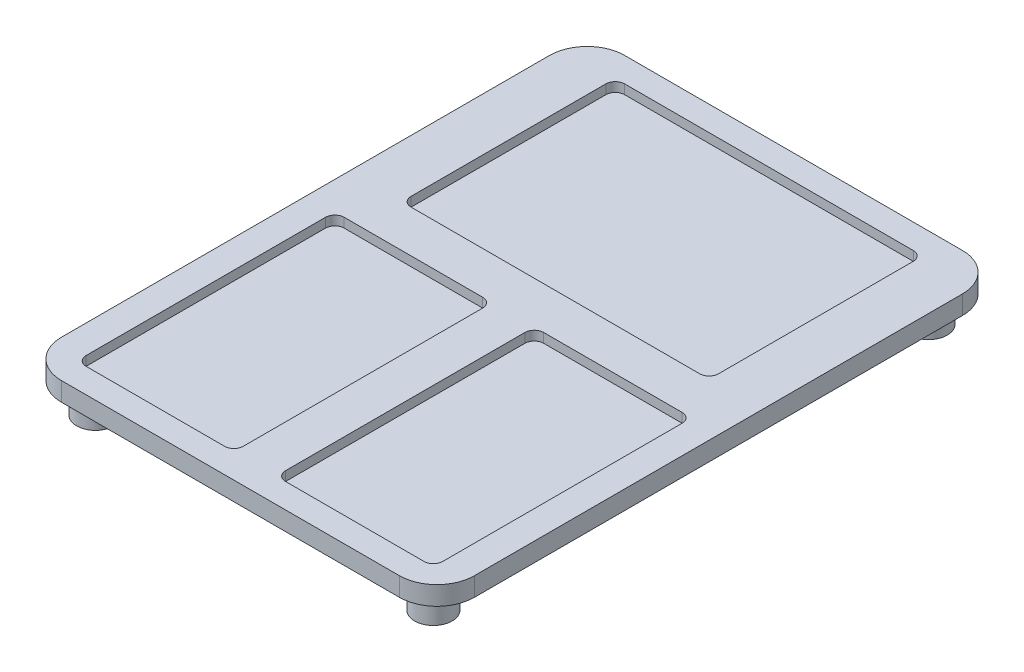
ISO-10303-21;
HEADER;
FILE_DESCRIPTION(('STEP AP214'),'2;1');
FILE_NAME('part.step','',(''),(''),'','','');
FILE_SCHEMA(('AUTOMOTIVE_DESIGN { 1 0 10303 214 1 1 1 1 }'));
ENDSEC;
DATA;
#1=APPLICATION_CONTEXT('core data for automotive mechanical design processes');
#2=APPLICATION_PROTOCOL_DEFINITION('international standard','automotive_design',2000,#1);
#3=PRODUCT_CONTEXT('',#1,'mechanical');
#4=PRODUCT('Part','Part','',(#3));
#5=PRODUCT_RELATED_PRODUCT_CATEGORY('part','',(#4));
#6=PRODUCT_DEFINITION_FORMATION('','',#4);
#7=PRODUCT_DEFINITION_CONTEXT('part definition',#1,'design');
#8=PRODUCT_DEFINITION('design','',#6,#7);
#9=PRODUCT_DEFINITION_SHAPE('','',#8);
#10=(LENGTH_UNIT() NAMED_UNIT(*) SI_UNIT(.MILLI.,.METRE.));
#11=(NAMED_UNIT(*) PLANE_ANGLE_UNIT() SI_UNIT($,.RADIAN.));
#12=(NAMED_UNIT(*) SI_UNIT($,.STERADIAN.) SOLID_ANGLE_UNIT());
#13=UNCERTAINTY_MEASURE_WITH_UNIT(LENGTH_MEASURE(1.E-05),#10,'distance_accuracy_value','');
#14=(GEOMETRIC_REPRESENTATION_CONTEXT(3) GLOBAL_UNCERTAINTY_ASSIGNED_CONTEXT((#13)) GLOBAL_UNIT_ASSIGNED_CONTEXT((#10,
#11,#12)) REPRESENTATION_CONTEXT('',''));
#15=CARTESIAN_POINT('',(0.,0.,0.));
#16=DIRECTION('',(0.,0.,1.));
#17=DIRECTION('',(1.,0.,0.));
#18=AXIS2_PLACEMENT_3D('',#15,#16,#17);
#19=CARTESIAN_POINT('',(-228.6,25.4,-330.2));
#20=DIRECTION('',(0.,-1.,0.));
#21=DIRECTION('',(0.,0.,-1.));
#22=AXIS2_PLACEMENT_3D('',#19,#20,#21);
#23=CYLINDRICAL_SURFACE('',#22,50.8);
#24=CARTESIAN_POINT('',(-228.6,0.,-330.2));
#25=DIRECTION('',(0.,1.,0.));
#26=DIRECTION('',(0.,0.,-1.));
#27=AXIS2_PLACEMENT_3D('',#24,#25,#26);
#28=CIRCLE('',#27,50.8);
#29=CARTESIAN_POINT('',(-228.6,0.,-381.));
#30=VERTEX_POINT('',#29);
#31=CARTESIAN_POINT('',(-279.4,0.,-330.2));
#32=VERTEX_POINT('',#31);
#33=EDGE_CURVE('E319',#30,#32,#28,.T.);
#34=ORIENTED_EDGE('',*,*,#33,.T.);
#35=DIRECTION('',(0.,-1.,0.));
#36=VECTOR('',#35,1.);
#37=CARTESIAN_POINT('',(-279.4,25.4,-330.2));
#38=LINE('',#37,#36);
#39=CARTESIAN_POINT('',(-279.4,25.4,-330.2));
#40=VERTEX_POINT('',#39);
#41=EDGE_CURVE('E13',#40,#32,#38,.T.);
#42=ORIENTED_EDGE('',*,*,#41,.F.);
#43=CARTESIAN_POINT('',(-228.6,25.4,-330.2));
#44=DIRECTION('',(0.,1.,0.));
#45=DIRECTION('',(0.,0.,-1.));
#46=AXIS2_PLACEMENT_3D('',#43,#44,#45);
#47=CIRCLE('',#46,50.8);
#48=CARTESIAN_POINT('',(-228.6,25.4,-381.));
#49=VERTEX_POINT('',#48);
#50=EDGE_CURVE('E457',#49,#40,#47,.T.);
#51=ORIENTED_EDGE('',*,*,#50,.F.);
#52=DIRECTION('',(0.,-1.,0.));
#53=VECTOR('',#52,1.);
#54=CARTESIAN_POINT('',(-228.6,25.4,-381.));
#55=LINE('',#54,#53);
#56=EDGE_CURVE('E475',#49,#30,#55,.T.);
#57=ORIENTED_EDGE('',*,*,#56,.T.);
#58=EDGE_LOOP('',(#34,#42,#51,#57));
#59=FACE_BOUND('',#58,.T.);
#60=ADVANCED_FACE('F48',(#59),#23,.T.);
#61=CARTESIAN_POINT('',(-279.4,25.4,330.2));
#62=DIRECTION('',(1.,0.,0.));
#63=DIRECTION('',(0.,0.,-1.));
#64=AXIS2_PLACEMENT_3D('',#61,#62,#63);
#65=PLANE('',#64);
#66=DIRECTION('',(0.,0.,1.));
#67=VECTOR('',#66,1.);
#68=CARTESIAN_POINT('',(-279.4,0.,330.2));
#69=LINE('',#68,#67);
#70=CARTESIAN_POINT('',(-279.4,0.,330.2));
#71=VERTEX_POINT('',#70);
#72=EDGE_CURVE('E478',#32,#71,#69,.T.);
#73=ORIENTED_EDGE('',*,*,#72,.T.);
#74=DIRECTION('',(0.,-1.,0.));
#75=VECTOR('',#74,1.);
#76=CARTESIAN_POINT('',(-279.4,25.4,330.2));
#77=LINE('',#76,#75);
#78=CARTESIAN_POINT('',(-279.4,25.4,330.2));
#79=VERTEX_POINT('',#78);
#80=EDGE_CURVE('E55',#79,#71,#77,.T.);
#81=ORIENTED_EDGE('',*,*,#80,.F.);
#82=DIRECTION('',(0.,0.,1.));
#83=VECTOR('',#82,1.);
#84=CARTESIAN_POINT('',(-279.4,25.4,330.2));
#85=LINE('',#84,#83);
#86=EDGE_CURVE('E460',#40,#79,#85,.T.);
#87=ORIENTED_EDGE('',*,*,#86,.F.);
#88=ORIENTED_EDGE('',*,*,#41,.T.);
#89=EDGE_LOOP('',(#73,#81,#87,#88));
#90=FACE_BOUND('',#89,.T.);
#91=ADVANCED_FACE('F535',(#90),#65,.F.);
#92=CARTESIAN_POINT('',(-228.6,25.4,330.2));
#93=DIRECTION('',(0.,-1.,0.));
#94=DIRECTION('',(0.,0.,-1.));
#95=AXIS2_PLACEMENT_3D('',#92,#93,#94);
#96=CYLINDRICAL_SURFACE('',#95,50.8);
#97=CARTESIAN_POINT('',(-228.6,0.,330.2));
#98=DIRECTION('',(0.,1.,0.));
#99=DIRECTION('',(0.,0.,-1.));
#100=AXIS2_PLACEMENT_3D('',#97,#98,#99);
#101=CIRCLE('',#100,50.8);
#102=CARTESIAN_POINT('',(-228.6,0.,381.));
#103=VERTEX_POINT('',#102);
#104=EDGE_CURVE('E480',#71,#103,#101,.T.);
#105=ORIENTED_EDGE('',*,*,#104,.T.);
#106=DIRECTION('',(0.,-1.,0.));
#107=VECTOR('',#106,1.);
#108=CARTESIAN_POINT('',(-228.6,25.4,381.));
#109=LINE('',#108,#107);
#110=CARTESIAN_POINT('',(-228.6,25.4,381.));
#111=VERTEX_POINT('',#110);
#112=EDGE_CURVE('E505',#111,#103,#109,.T.);
#113=ORIENTED_EDGE('',*,*,#112,.F.);
#114=CARTESIAN_POINT('',(-228.6,25.4,330.2));
#115=DIRECTION('',(0.,1.,0.));
#116=DIRECTION('',(0.,0.,-1.));
#117=AXIS2_PLACEMENT_3D('',#114,#115,#116);
#118=CIRCLE('',#117,50.8);
#119=EDGE_CURVE('E463',#79,#111,#118,.T.);
#120=ORIENTED_EDGE('',*,*,#119,.F.);
#121=ORIENTED_EDGE('',*,*,#80,.T.);
#122=EDGE_LOOP('',(#105,#113,#120,#121));
#123=FACE_BOUND('',#122,.T.);
#124=ADVANCED_FACE('F512',(#123),#96,.T.);
#125=CARTESIAN_POINT('',(228.6,25.4,381.));
#126=DIRECTION('',(0.,0.,-1.));
#127=DIRECTION('',(-1.,0.,0.));
#128=AXIS2_PLACEMENT_3D('',#125,#126,#127);
#129=PLANE('',#128);
#130=DIRECTION('',(1.,0.,0.));
#131=VECTOR('',#130,1.);
#132=CARTESIAN_POINT('',(228.6,0.,381.));
#133=LINE('',#132,#131);
#134=CARTESIAN_POINT('',(228.6,0.,381.));
#135=VERTEX_POINT('',#134);
#136=EDGE_CURVE('E482',#103,#135,#133,.T.);
#137=ORIENTED_EDGE('',*,*,#136,.T.);
#138=DIRECTION('',(0.,-1.,0.));
#139=VECTOR('',#138,1.);
#140=CARTESIAN_POINT('',(228.6,25.4,381.));
#141=LINE('',#140,#139);
#142=CARTESIAN_POINT('',(228.6,25.4,381.));
#143=VERTEX_POINT('',#142);
#144=EDGE_CURVE('E502',#143,#135,#141,.T.);
#145=ORIENTED_EDGE('',*,*,#144,.F.);
#146=DIRECTION('',(1.,0.,0.));
#147=VECTOR('',#146,1.);
#148=CARTESIAN_POINT('',(228.6,25.4,381.));
#149=LINE('',#148,#147);
#150=EDGE_CURVE('E465',#111,#143,#149,.T.);
#151=ORIENTED_EDGE('',*,*,#150,.F.);
#152=ORIENTED_EDGE('',*,*,#112,.T.);
#153=EDGE_LOOP('',(#137,#145,#151,#152));
#154=FACE_BOUND('',#153,.T.);
#155=ADVANCED_FACE('F523',(#154),#129,.F.);
#156=CARTESIAN_POINT('',(228.6,25.4,330.2));
#157=DIRECTION('',(0.,-1.,0.));
#158=DIRECTION('',(0.,0.,-1.));
#159=AXIS2_PLACEMENT_3D('',#156,#157,#158);
#160=CYLINDRICAL_SURFACE('',#159,50.8);
#161=CARTESIAN_POINT('',(228.6,0.,330.2));
#162=DIRECTION('',(0.,1.,0.));
#163=DIRECTION('',(0.,0.,-1.));
#164=AXIS2_PLACEMENT_3D('',#161,#162,#163);
#165=CIRCLE('',#164,50.8);
#166=CARTESIAN_POINT('',(279.4,0.,330.2));
#167=VERTEX_POINT('',#166);
#168=EDGE_CURVE('E484',#135,#167,#165,.T.);
#169=ORIENTED_EDGE('',*,*,#168,.T.);
#170=DIRECTION('',(0.,-1.,0.));
#171=VECTOR('',#170,1.);
#172=CARTESIAN_POINT('',(279.4,25.4,330.2));
#173=LINE('',#172,#171);
#174=CARTESIAN_POINT('',(279.4,25.4,330.2));
#175=VERTEX_POINT('',#174);
#176=EDGE_CURVE('E499',#175,#167,#173,.T.);
#177=ORIENTED_EDGE('',*,*,#176,.F.);
#178=CARTESIAN_POINT('',(228.6,25.4,330.2));
#179=DIRECTION('',(0.,1.,0.));
#180=DIRECTION('',(0.,0.,-1.));
#181=AXIS2_PLACEMENT_3D('',#178,#179,#180);
#182=CIRCLE('',#181,50.8);
#183=EDGE_CURVE('E467',#143,#175,#182,.T.);
#184=ORIENTED_EDGE('',*,*,#183,.F.);
#185=ORIENTED_EDGE('',*,*,#144,.T.);
#186=EDGE_LOOP('',(#169,#177,#184,#185));
#187=FACE_BOUND('',#186,.T.);
#188=ADVANCED_FACE('F527',(#187),#160,.T.);
#189=CARTESIAN_POINT('',(279.4,25.4,330.2));
#190=DIRECTION('',(-1.,0.,0.));
#191=DIRECTION('',(0.,0.,1.));
#192=AXIS2_PLACEMENT_3D('',#189,#190,#191);
#193=PLANE('',#192);
#194=DIRECTION('',(0.,0.,-1.));
#195=VECTOR('',#194,1.);
#196=CARTESIAN_POINT('',(279.4,0.,330.2));
#197=LINE('',#196,#195);
#198=CARTESIAN_POINT('',(279.4,0.,-330.2));
#199=VERTEX_POINT('',#198);
#200=EDGE_CURVE('E486',#167,#199,#197,.T.);
#201=ORIENTED_EDGE('',*,*,#200,.T.);
#202=DIRECTION('',(0.,-1.,0.));
#203=VECTOR('',#202,1.);
#204=CARTESIAN_POINT('',(279.4,25.4,-330.2));
#205=LINE('',#204,#203);
#206=CARTESIAN_POINT('',(279.4,25.4,-330.2));
#207=VERTEX_POINT('',#206);
#208=EDGE_CURVE('E496',#207,#199,#205,.T.);
#209=ORIENTED_EDGE('',*,*,#208,.F.);
#210=DIRECTION('',(0.,0.,-1.));
#211=VECTOR('',#210,1.);
#212=CARTESIAN_POINT('',(279.4,25.4,330.2));
#213=LINE('',#212,#211);
#214=EDGE_CURVE('E469',#175,#207,#213,.T.);
#215=ORIENTED_EDGE('',*,*,#214,.F.);
#216=ORIENTED_EDGE('',*,*,#176,.T.);
#217=EDGE_LOOP('',(#201,#209,#215,#216));
#218=FACE_BOUND('',#217,.T.);
#219=ADVANCED_FACE('F548',(#218),#193,.F.);
#220=CARTESIAN_POINT('',(228.6,25.4,-330.2));
#221=DIRECTION('',(0.,-1.,0.));
#222=DIRECTION('',(0.,0.,-1.));
#223=AXIS2_PLACEMENT_3D('',#220,#221,#222);
#224=CYLINDRICAL_SURFACE('',#223,50.8);
#225=CARTESIAN_POINT('',(228.6,0.,-330.2));
#226=DIRECTION('',(0.,1.,0.));
#227=DIRECTION('',(0.,0.,1.));
#228=AXIS2_PLACEMENT_3D('',#225,#226,#227);
#229=CIRCLE('',#228,50.8);
#230=CARTESIAN_POINT('',(228.6,0.,-381.));
#231=VERTEX_POINT('',#230);
#232=EDGE_CURVE('E488',#199,#231,#229,.T.);
#233=ORIENTED_EDGE('',*,*,#232,.T.);
#234=DIRECTION('',(0.,-1.,0.));
#235=VECTOR('',#234,1.);
#236=CARTESIAN_POINT('',(228.6,25.4,-381.));
#237=LINE('',#236,#235);
#238=CARTESIAN_POINT('',(228.6,25.4,-381.));
#239=VERTEX_POINT('',#238);
#240=EDGE_CURVE('E493',#239,#231,#237,.T.);
#241=ORIENTED_EDGE('',*,*,#240,.F.);
#242=CARTESIAN_POINT('',(228.6,25.4,-330.2));
#243=DIRECTION('',(0.,1.,0.));
#244=DIRECTION('',(0.,0.,1.));
#245=AXIS2_PLACEMENT_3D('',#242,#243,#244);
#246=CIRCLE('',#245,50.8);
#247=EDGE_CURVE('E471',#207,#239,#246,.T.);
#248=ORIENTED_EDGE('',*,*,#247,.F.);
#249=ORIENTED_EDGE('',*,*,#208,.T.);
#250=EDGE_LOOP('',(#233,#241,#248,#249));
#251=FACE_BOUND('',#250,.T.);
#252=ADVANCED_FACE('F546',(#251),#224,.T.);
#253=CARTESIAN_POINT('',(228.6,25.4,-381.));
#254=DIRECTION('',(0.,0.,1.));
#255=DIRECTION('',(1.,0.,0.));
#256=AXIS2_PLACEMENT_3D('',#253,#254,#255);
#257=PLANE('',#256);
#258=DIRECTION('',(-1.,0.,0.));
#259=VECTOR('',#258,1.);
#260=CARTESIAN_POINT('',(228.6,0.,-381.));
#261=LINE('',#260,#259);
#262=EDGE_CURVE('E461',#231,#30,#261,.T.);
#263=ORIENTED_EDGE('',*,*,#262,.T.);
#264=ORIENTED_EDGE('',*,*,#56,.F.);
#265=DIRECTION('',(-1.,0.,0.));
#266=VECTOR('',#265,1.);
#267=CARTESIAN_POINT('',(228.6,25.4,-381.));
#268=LINE('',#267,#266);
#269=EDGE_CURVE('E473',#239,#49,#268,.T.);
#270=ORIENTED_EDGE('',*,*,#269,.F.);
#271=ORIENTED_EDGE('',*,*,#240,.T.);
#272=EDGE_LOOP('',(#263,#264,#270,#271));
#273=FACE_BOUND('',#272,.T.);
#274=ADVANCED_FACE('F541',(#273),#257,.F.);
#275=CARTESIAN_POINT('',(-228.6,25.4,-330.2));
#276=DIRECTION('',(0.,-1.,0.));
#277=DIRECTION('',(0.,0.,-1.));
#278=AXIS2_PLACEMENT_3D('',#275,#276,#277);
#279=PLANE('',#278);
#280=DIRECTION('',(0.,0.,-1.));
#281=VECTOR('',#280,1.);
#282=CARTESIAN_POINT('',(207.9625,25.4,-71.4375));
#283=LINE('',#282,#281);
#284=CARTESIAN_POINT('',(207.9625,25.4,-71.4375));
#285=VERTEX_POINT('',#284);
#286=CARTESIAN_POINT('',(207.9625,25.4,-334.9625));
#287=VERTEX_POINT('',#286);
#288=EDGE_CURVE('E300',#285,#287,#283,.T.);
#289=ORIENTED_EDGE('',*,*,#288,.F.);
#290=CARTESIAN_POINT('',(195.2625,25.4,-71.4375));
#291=DIRECTION('',(0.,1.,0.));
#292=DIRECTION('',(0.,0.,1.));
#293=AXIS2_PLACEMENT_3D('',#290,#291,#292);
#294=CIRCLE('',#293,12.7);
#295=CARTESIAN_POINT('',(195.2625,25.4,-58.7375));
#296=VERTEX_POINT('',#295);
#297=EDGE_CURVE('E62',#296,#285,#294,.T.);
#298=ORIENTED_EDGE('',*,*,#297,.F.);
#299=DIRECTION('',(1.,0.,0.));
#300=VECTOR('',#299,1.);
#301=CARTESIAN_POINT('',(-195.2625,25.4,-58.7374999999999));
#302=LINE('',#301,#300);
#303=CARTESIAN_POINT('',(-195.2625,25.4,-58.7374999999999));
#304=VERTEX_POINT('',#303);
#305=EDGE_CURVE('E277',#304,#296,#302,.T.);
#306=ORIENTED_EDGE('',*,*,#305,.F.);
#307=CARTESIAN_POINT('',(-195.2625,25.4,-71.4374999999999));
#308=DIRECTION('',(0.,1.,0.));
#309=DIRECTION('',(0.,0.,-1.));
#310=AXIS2_PLACEMENT_3D('',#307,#308,#309);
#311=CIRCLE('',#310,12.7);
#312=CARTESIAN_POINT('',(-207.9625,25.4,-71.4374999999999));
#313=VERTEX_POINT('',#312);
#314=EDGE_CURVE('E280',#313,#304,#311,.T.);
#315=ORIENTED_EDGE('',*,*,#314,.F.);
#316=DIRECTION('',(0.,0.,1.));
#317=VECTOR('',#316,1.);
#318=CARTESIAN_POINT('',(-207.9625,25.4,-71.4374999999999));
#319=LINE('',#318,#317);
#320=CARTESIAN_POINT('',(-207.9625,25.4,-334.9625));
#321=VERTEX_POINT('',#320);
#322=EDGE_CURVE('E312',#321,#313,#319,.T.);
#323=ORIENTED_EDGE('',*,*,#322,.F.);
#324=CARTESIAN_POINT('',(-195.2625,25.4,-334.9625));
#325=DIRECTION('',(0.,1.,0.));
#326=DIRECTION('',(0.,0.,-1.));
#327=AXIS2_PLACEMENT_3D('',#324,#325,#326);
#328=CIRCLE('',#327,12.7);
#329=CARTESIAN_POINT('',(-195.2625,25.4,-347.6625));
#330=VERTEX_POINT('',#329);
#331=EDGE_CURVE('E309',#330,#321,#328,.T.);
#332=ORIENTED_EDGE('',*,*,#331,.F.);
#333=DIRECTION('',(-1.,0.,0.));
#334=VECTOR('',#333,1.);
#335=CARTESIAN_POINT('',(-195.2625,25.4,-347.6625));
#336=LINE('',#335,#334);
#337=CARTESIAN_POINT('',(195.2625,25.4,-347.6625));
#338=VERTEX_POINT('',#337);
#339=EDGE_CURVE('E306',#338,#330,#336,.T.);
#340=ORIENTED_EDGE('',*,*,#339,.F.);
#341=CARTESIAN_POINT('',(195.2625,25.4,-334.9625));
#342=DIRECTION('',(0.,1.,0.));
#343=DIRECTION('',(0.,0.,-1.));
#344=AXIS2_PLACEMENT_3D('',#341,#342,#343);
#345=CIRCLE('',#344,12.7);
#346=EDGE_CURVE('E303',#287,#338,#345,.T.);
#347=ORIENTED_EDGE('',*,*,#346,.F.);
#348=EDGE_LOOP('',(#289,#298,#306,#315,#323,#332,#340,#347));
#349=FACE_BOUND('',#348,.T.);
#350=DIRECTION('',(-1.,0.,0.));
#351=VECTOR('',#350,1.);
#352=CARTESIAN_POINT('',(41.2750000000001,25.4,-1.58750000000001));
#353=LINE('',#352,#351);
#354=CARTESIAN_POINT('',(228.6,25.4,-1.58750000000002));
#355=VERTEX_POINT('',#354);
#356=CARTESIAN_POINT('',(41.2750000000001,25.4,-1.58750000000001));
#357=VERTEX_POINT('',#356);
#358=EDGE_CURVE('E358',#355,#357,#353,.T.);
#359=ORIENTED_EDGE('',*,*,#358,.F.);
#360=CARTESIAN_POINT('',(228.6,25.4,11.1125));
#361=DIRECTION('',(0.,1.,0.));
#362=DIRECTION('',(0.,0.,-1.));
#363=AXIS2_PLACEMENT_3D('',#360,#361,#362);
#364=CIRCLE('',#363,12.7);
#365=CARTESIAN_POINT('',(241.3,25.4,11.1125));
#366=VERTEX_POINT('',#365);
#367=EDGE_CURVE('E70',#366,#355,#364,.T.);
#368=ORIENTED_EDGE('',*,*,#367,.F.);
#369=DIRECTION('',(0.,0.,-1.));
#370=VECTOR('',#369,1.);
#371=CARTESIAN_POINT('',(241.3,25.4,11.1125));
#372=LINE('',#371,#370);
#373=CARTESIAN_POINT('',(241.3,25.4,334.9625));
#374=VERTEX_POINT('',#373);
#375=EDGE_CURVE('E335',#374,#366,#372,.T.);
#376=ORIENTED_EDGE('',*,*,#375,.F.);
#377=CARTESIAN_POINT('',(228.6,25.4,334.9625));
#378=DIRECTION('',(0.,1.,0.));
#379=DIRECTION('',(0.,0.,1.));
#380=AXIS2_PLACEMENT_3D('',#377,#378,#379);
#381=CIRCLE('',#380,12.7);
#382=CARTESIAN_POINT('',(228.6,25.4,347.6625));
#383=VERTEX_POINT('',#382);
#384=EDGE_CURVE('E374',#383,#374,#381,.T.);
#385=ORIENTED_EDGE('',*,*,#384,.F.);
#386=DIRECTION('',(1.,0.,0.));
#387=VECTOR('',#386,1.);
#388=CARTESIAN_POINT('',(41.2750000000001,25.4,347.6625));
#389=LINE('',#388,#387);
#390=CARTESIAN_POINT('',(41.2750000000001,25.4,347.6625));
#391=VERTEX_POINT('',#390);
#392=EDGE_CURVE('E371',#391,#383,#389,.T.);
#393=ORIENTED_EDGE('',*,*,#392,.F.);
#394=CARTESIAN_POINT('',(41.2750000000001,25.4,334.9625));
#395=DIRECTION('',(0.,1.,0.));
#396=DIRECTION('',(0.,0.,1.));
#397=AXIS2_PLACEMENT_3D('',#394,#395,#396);
#398=CIRCLE('',#397,12.7);
#399=CARTESIAN_POINT('',(28.5750000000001,25.4,334.9625));
#400=VERTEX_POINT('',#399);
#401=EDGE_CURVE('E368',#400,#391,#398,.T.);
#402=ORIENTED_EDGE('',*,*,#401,.F.);
#403=DIRECTION('',(0.,0.,1.));
#404=VECTOR('',#403,1.);
#405=CARTESIAN_POINT('',(28.575,25.4,11.1125));
#406=LINE('',#405,#404);
#407=CARTESIAN_POINT('',(28.575,25.4,11.1125));
#408=VERTEX_POINT('',#407);
#409=EDGE_CURVE('E365',#408,#400,#406,.T.);
#410=ORIENTED_EDGE('',*,*,#409,.F.);
#411=CARTESIAN_POINT('',(41.2750000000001,25.4,11.1125));
#412=DIRECTION('',(0.,1.,0.));
#413=DIRECTION('',(0.,0.,1.));
#414=AXIS2_PLACEMENT_3D('',#411,#412,#413);
#415=CIRCLE('',#414,12.7);
#416=EDGE_CURVE('E362',#357,#408,#415,.T.);
#417=ORIENTED_EDGE('',*,*,#416,.F.);
#418=EDGE_LOOP('',(#359,#368,#376,#385,#393,#402,#410,#417));
#419=FACE_BOUND('',#418,.T.);
#420=DIRECTION('',(1.,0.,0.));
#421=VECTOR('',#420,1.);
#422=CARTESIAN_POINT('',(-228.6,25.4,347.6625));
#423=LINE('',#422,#421);
#424=CARTESIAN_POINT('',(-228.6,25.4,347.6625));
#425=VERTEX_POINT('',#424);
#426=CARTESIAN_POINT('',(-41.2749999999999,25.4,347.6625));
#427=VERTEX_POINT('',#426);
#428=EDGE_CURVE('E421',#425,#427,#423,.T.);
#429=ORIENTED_EDGE('',*,*,#428,.F.);
#430=CARTESIAN_POINT('',(-228.6,25.4,334.9625));
#431=DIRECTION('',(0.,1.,0.));
#432=DIRECTION('',(0.,0.,1.));
#433=AXIS2_PLACEMENT_3D('',#430,#431,#432);
#434=CIRCLE('',#433,12.7);
#435=CARTESIAN_POINT('',(-241.3,25.4,334.9625));
#436=VERTEX_POINT('',#435);
#437=EDGE_CURVE('E419',#436,#425,#434,.T.);
#438=ORIENTED_EDGE('',*,*,#437,.F.);
#439=DIRECTION('',(0.,0.,1.));
#440=VECTOR('',#439,1.);
#441=CARTESIAN_POINT('',(-241.3,25.4,11.1125));
#442=LINE('',#441,#440);
#443=CARTESIAN_POINT('',(-241.3,25.4,11.1125));
#444=VERTEX_POINT('',#443);
#445=EDGE_CURVE('E397',#444,#436,#442,.T.);
#446=ORIENTED_EDGE('',*,*,#445,.F.);
#447=CARTESIAN_POINT('',(-228.6,25.4,11.1125));
#448=DIRECTION('',(0.,1.,0.));
#449=DIRECTION('',(0.,0.,1.));
#450=AXIS2_PLACEMENT_3D('',#447,#448,#449);
#451=CIRCLE('',#450,12.7);
#452=CARTESIAN_POINT('',(-228.6,25.4,-1.58750000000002));
#453=VERTEX_POINT('',#452);
#454=EDGE_CURVE('E437',#453,#444,#451,.T.);
#455=ORIENTED_EDGE('',*,*,#454,.F.);
#456=DIRECTION('',(-1.,0.,0.));
#457=VECTOR('',#456,1.);
#458=CARTESIAN_POINT('',(-228.6,25.4,-1.58750000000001));
#459=LINE('',#458,#457);
#460=CARTESIAN_POINT('',(-41.275,25.4,-1.58750000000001));
#461=VERTEX_POINT('',#460);
#462=EDGE_CURVE('E434',#461,#453,#459,.T.);
#463=ORIENTED_EDGE('',*,*,#462,.F.);
#464=CARTESIAN_POINT('',(-41.275,25.4,11.1125));
#465=DIRECTION('',(0.,1.,0.));
#466=DIRECTION('',(0.,0.,-1.));
#467=AXIS2_PLACEMENT_3D('',#464,#465,#466);
#468=CIRCLE('',#467,12.7);
#469=CARTESIAN_POINT('',(-28.5749999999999,25.4,11.1125));
#470=VERTEX_POINT('',#469);
#471=EDGE_CURVE('E431',#470,#461,#468,.T.);
#472=ORIENTED_EDGE('',*,*,#471,.F.);
#473=DIRECTION('',(0.,0.,-1.));
#474=VECTOR('',#473,1.);
#475=CARTESIAN_POINT('',(-28.5749999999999,25.4,11.1125));
#476=LINE('',#475,#474);
#477=CARTESIAN_POINT('',(-28.5749999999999,25.4,334.9625));
#478=VERTEX_POINT('',#477);
#479=EDGE_CURVE('E428',#478,#470,#476,.T.);
#480=ORIENTED_EDGE('',*,*,#479,.F.);
#481=CARTESIAN_POINT('',(-41.2749999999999,25.4,334.9625));
#482=DIRECTION('',(0.,1.,0.));
#483=DIRECTION('',(0.,0.,1.));
#484=AXIS2_PLACEMENT_3D('',#481,#482,#483);
#485=CIRCLE('',#484,12.7);
#486=EDGE_CURVE('E425',#427,#478,#485,.T.);
#487=ORIENTED_EDGE('',*,*,#486,.F.);
#488=EDGE_LOOP('',(#429,#438,#446,#455,#463,#472,#480,#487));
#489=FACE_BOUND('',#488,.T.);
#490=ORIENTED_EDGE('',*,*,#50,.T.);
#491=ORIENTED_EDGE('',*,*,#86,.T.);
#492=ORIENTED_EDGE('',*,*,#119,.T.);
#493=ORIENTED_EDGE('',*,*,#150,.T.);
#494=ORIENTED_EDGE('',*,*,#183,.T.);
#495=ORIENTED_EDGE('',*,*,#214,.T.);
#496=ORIENTED_EDGE('',*,*,#247,.T.);
#497=ORIENTED_EDGE('',*,*,#269,.T.);
#498=EDGE_LOOP('',(#490,#491,#492,#493,#494,#495,#496,#497));
#499=FACE_BOUND('',#498,.T.);
#500=ADVANCED_FACE('F531',(#349,#419,#489,#499),#279,.F.);
#501=CARTESIAN_POINT('',(-228.6,0.,-330.2));
#502=DIRECTION('',(0.,-1.,0.));
#503=DIRECTION('',(0.,0.,-1.));
#504=AXIS2_PLACEMENT_3D('',#501,#502,#503);
#505=PLANE('',#504);
#506=CARTESIAN_POINT('',(228.6,0.,334.9625));
#507=DIRECTION('',(0.,-1.,0.));
#508=DIRECTION('',(0.,0.,1.));
#509=AXIS2_PLACEMENT_3D('',#506,#507,#508);
#510=CIRCLE('',#509,25.4);
#511=CARTESIAN_POINT('',(228.6,0.,360.3625));
#512=VERTEX_POINT('',#511);
#513=EDGE_CURVE('E962',#512,#512,#510,.T.);
#514=ORIENTED_EDGE('',*,*,#513,.F.);
#515=EDGE_LOOP('',(#514));
#516=FACE_BOUND('',#515,.T.);
#517=CARTESIAN_POINT('',(228.6,0.,-334.9625));
#518=DIRECTION('',(0.,-1.,0.));
#519=DIRECTION('',(0.,0.,1.));
#520=AXIS2_PLACEMENT_3D('',#517,#518,#519);
#521=CIRCLE('',#520,25.4);
#522=CARTESIAN_POINT('',(228.6,0.,-309.5625));
#523=VERTEX_POINT('',#522);
#524=EDGE_CURVE('E961',#523,#523,#521,.T.);
#525=ORIENTED_EDGE('',*,*,#524,.F.);
#526=EDGE_LOOP('',(#525));
#527=FACE_BOUND('',#526,.T.);
#528=CARTESIAN_POINT('',(-228.6,0.,-334.9625));
#529=DIRECTION('',(0.,-1.,0.));
#530=DIRECTION('',(0.,0.,-1.));
#531=AXIS2_PLACEMENT_3D('',#528,#529,#530);
#532=CIRCLE('',#531,25.4);
#533=CARTESIAN_POINT('',(-228.6,0.,-309.5625));
#534=VERTEX_POINT('',#533);
#535=EDGE_CURVE('E971',#534,#534,#532,.T.);
#536=ORIENTED_EDGE('',*,*,#535,.F.);
#537=EDGE_LOOP('',(#536));
#538=FACE_BOUND('',#537,.T.);
#539=CARTESIAN_POINT('',(-228.6,0.,334.9625));
#540=DIRECTION('',(0.,-1.,0.));
#541=DIRECTION('',(0.,0.,-1.));
#542=AXIS2_PLACEMENT_3D('',#539,#540,#541);
#543=CIRCLE('',#542,25.4);
#544=CARTESIAN_POINT('',(-228.6,0.,360.3625));
#545=VERTEX_POINT('',#544);
#546=EDGE_CURVE('E283',#545,#545,#543,.T.);
#547=ORIENTED_EDGE('',*,*,#546,.F.);
#548=EDGE_LOOP('',(#547));
#549=FACE_BOUND('',#548,.T.);
#550=ORIENTED_EDGE('',*,*,#33,.F.);
#551=ORIENTED_EDGE('',*,*,#262,.F.);
#552=ORIENTED_EDGE('',*,*,#232,.F.);
#553=ORIENTED_EDGE('',*,*,#200,.F.);
#554=ORIENTED_EDGE('',*,*,#168,.F.);
#555=ORIENTED_EDGE('',*,*,#136,.F.);
#556=ORIENTED_EDGE('',*,*,#104,.F.);
#557=ORIENTED_EDGE('',*,*,#72,.F.);
#558=EDGE_LOOP('',(#550,#551,#552,#553,#554,#555,#556,#557));
#559=FACE_BOUND('',#558,.T.);
#560=ADVANCED_FACE('F518',(#516,#527,#538,#549,#559),#505,.T.);
#561=CARTESIAN_POINT('',(-228.6,12.7,334.9625));
#562=DIRECTION('',(0.,1.,0.));
#563=DIRECTION('',(0.,0.,1.));
#564=AXIS2_PLACEMENT_3D('',#561,#562,#563);
#565=CYLINDRICAL_SURFACE('',#564,12.7);
#566=ORIENTED_EDGE('',*,*,#437,.T.);
#567=DIRECTION('',(0.,1.,0.));
#568=VECTOR('',#567,1.);
#569=CARTESIAN_POINT('',(-228.6,12.7,347.6625));
#570=LINE('',#569,#568);
#571=CARTESIAN_POINT('',(-228.6,12.7,347.6625));
#572=VERTEX_POINT('',#571);
#573=EDGE_CURVE('E418',#572,#425,#570,.T.);
#574=ORIENTED_EDGE('',*,*,#573,.F.);
#575=CARTESIAN_POINT('',(-228.6,12.7,334.9625));
#576=DIRECTION('',(0.,1.,0.));
#577=DIRECTION('',(0.,0.,1.));
#578=AXIS2_PLACEMENT_3D('',#575,#576,#577);
#579=CIRCLE('',#578,12.7);
#580=CARTESIAN_POINT('',(-241.3,12.7,334.9625));
#581=VERTEX_POINT('',#580);
#582=EDGE_CURVE('E393',#581,#572,#579,.T.);
#583=ORIENTED_EDGE('',*,*,#582,.F.);
#584=DIRECTION('',(0.,1.,0.));
#585=VECTOR('',#584,1.);
#586=CARTESIAN_POINT('',(-241.3,12.7,334.9625));
#587=LINE('',#586,#585);
#588=EDGE_CURVE('E359',#581,#436,#587,.T.);
#589=ORIENTED_EDGE('',*,*,#588,.T.);
#590=EDGE_LOOP('',(#566,#574,#583,#589));
#591=FACE_BOUND('',#590,.T.);
#592=ADVANCED_FACE('F609',(#591),#565,.F.);
#593=CARTESIAN_POINT('',(-241.3,12.7,11.1125));
#594=DIRECTION('',(-1.,0.,0.));
#595=DIRECTION('',(0.,0.,1.));
#596=AXIS2_PLACEMENT_3D('',#593,#594,#595);
#597=PLANE('',#596);
#598=ORIENTED_EDGE('',*,*,#445,.T.);
#599=ORIENTED_EDGE('',*,*,#588,.F.);
#600=DIRECTION('',(0.,0.,1.));
#601=VECTOR('',#600,1.);
#602=CARTESIAN_POINT('',(-241.3,12.7,11.1125));
#603=LINE('',#602,#601);
#604=CARTESIAN_POINT('',(-241.3,12.7,11.1125));
#605=VERTEX_POINT('',#604);
#606=EDGE_CURVE('E415',#605,#581,#603,.T.);
#607=ORIENTED_EDGE('',*,*,#606,.F.);
#608=DIRECTION('',(0.,1.,0.));
#609=VECTOR('',#608,1.);
#610=CARTESIAN_POINT('',(-241.3,12.7,11.1125));
#611=LINE('',#610,#609);
#612=EDGE_CURVE('E443',#605,#444,#611,.T.);
#613=ORIENTED_EDGE('',*,*,#612,.T.);
#614=EDGE_LOOP('',(#598,#599,#607,#613));
#615=FACE_BOUND('',#614,.T.);
#616=ADVANCED_FACE('F614',(#615),#597,.F.);
#617=CARTESIAN_POINT('',(-228.6,12.7,11.1125));
#618=DIRECTION('',(0.,1.,0.));
#619=DIRECTION('',(0.,0.,1.));
#620=AXIS2_PLACEMENT_3D('',#617,#618,#619);
#621=CYLINDRICAL_SURFACE('',#620,12.7);
#622=ORIENTED_EDGE('',*,*,#454,.T.);
#623=ORIENTED_EDGE('',*,*,#612,.F.);
#624=CARTESIAN_POINT('',(-228.6,12.7,11.1125));
#625=DIRECTION('',(0.,1.,0.));
#626=DIRECTION('',(0.,0.,1.));
#627=AXIS2_PLACEMENT_3D('',#624,#625,#626);
#628=CIRCLE('',#627,12.7);
#629=CARTESIAN_POINT('',(-228.6,12.7,-1.58750000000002));
#630=VERTEX_POINT('',#629);
#631=EDGE_CURVE('E412',#630,#605,#628,.T.);
#632=ORIENTED_EDGE('',*,*,#631,.F.);
#633=DIRECTION('',(0.,1.,0.));
#634=VECTOR('',#633,1.);
#635=CARTESIAN_POINT('',(-228.6,12.7,-1.58750000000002));
#636=LINE('',#635,#634);
#637=EDGE_CURVE('E445',#630,#453,#636,.T.);
#638=ORIENTED_EDGE('',*,*,#637,.T.);
#639=EDGE_LOOP('',(#622,#623,#632,#638));
#640=FACE_BOUND('',#639,.T.);
#641=ADVANCED_FACE('F624',(#640),#621,.F.);
#642=CARTESIAN_POINT('',(-228.6,12.7,-1.58750000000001));
#643=DIRECTION('',(0.,0.,-1.));
#644=DIRECTION('',(-1.,0.,0.));
#645=AXIS2_PLACEMENT_3D('',#642,#643,#644);
#646=PLANE('',#645);
#647=ORIENTED_EDGE('',*,*,#462,.T.);
#648=ORIENTED_EDGE('',*,*,#637,.F.);
#649=DIRECTION('',(-1.,0.,0.));
#650=VECTOR('',#649,1.);
#651=CARTESIAN_POINT('',(-228.6,12.7,-1.58750000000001));
#652=LINE('',#651,#650);
#653=CARTESIAN_POINT('',(-41.275,12.7,-1.58750000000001));
#654=VERTEX_POINT('',#653);
#655=EDGE_CURVE('E409',#654,#630,#652,.T.);
#656=ORIENTED_EDGE('',*,*,#655,.F.);
#657=DIRECTION('',(0.,1.,0.));
#658=VECTOR('',#657,1.);
#659=CARTESIAN_POINT('',(-41.275,12.7,-1.58750000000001));
#660=LINE('',#659,#658);
#661=EDGE_CURVE('E447',#654,#461,#660,.T.);
#662=ORIENTED_EDGE('',*,*,#661,.T.);
#663=EDGE_LOOP('',(#647,#648,#656,#662));
#664=FACE_BOUND('',#663,.T.);
#665=ADVANCED_FACE('F634',(#664),#646,.F.);
#666=CARTESIAN_POINT('',(-41.275,12.7,11.1125));
#667=DIRECTION('',(0.,1.,0.));
#668=DIRECTION('',(0.,0.,1.));
#669=AXIS2_PLACEMENT_3D('',#666,#667,#668);
#670=CYLINDRICAL_SURFACE('',#669,12.7);
#671=ORIENTED_EDGE('',*,*,#471,.T.);
#672=ORIENTED_EDGE('',*,*,#661,.F.);
#673=CARTESIAN_POINT('',(-41.275,12.7,11.1125));
#674=DIRECTION('',(0.,1.,0.));
#675=DIRECTION('',(0.,0.,-1.));
#676=AXIS2_PLACEMENT_3D('',#673,#674,#675);
#677=CIRCLE('',#676,12.7);
#678=CARTESIAN_POINT('',(-28.5749999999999,12.7,11.1125));
#679=VERTEX_POINT('',#678);
#680=EDGE_CURVE('E406',#679,#654,#677,.T.);
#681=ORIENTED_EDGE('',*,*,#680,.F.);
#682=DIRECTION('',(0.,1.,0.));
#683=VECTOR('',#682,1.);
#684=CARTESIAN_POINT('',(-28.5749999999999,12.7,11.1125));
#685=LINE('',#684,#683);
#686=EDGE_CURVE('E449',#679,#470,#685,.T.);
#687=ORIENTED_EDGE('',*,*,#686,.T.);
#688=EDGE_LOOP('',(#671,#672,#681,#687));
#689=FACE_BOUND('',#688,.T.);
#690=ADVANCED_FACE('F644',(#689),#670,.F.);
#691=CARTESIAN_POINT('',(-28.5749999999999,12.7,11.1125));
#692=DIRECTION('',(1.,0.,0.));
#693=DIRECTION('',(0.,0.,-1.));
#694=AXIS2_PLACEMENT_3D('',#691,#692,#693);
#695=PLANE('',#694);
#696=ORIENTED_EDGE('',*,*,#479,.T.);
#697=ORIENTED_EDGE('',*,*,#686,.F.);
#698=DIRECTION('',(0.,0.,-1.));
#699=VECTOR('',#698,1.);
#700=CARTESIAN_POINT('',(-28.5749999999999,12.7,11.1125));
#701=LINE('',#700,#699);
#702=CARTESIAN_POINT('',(-28.5749999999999,12.7,334.9625));
#703=VERTEX_POINT('',#702);
#704=EDGE_CURVE('E403',#703,#679,#701,.T.);
#705=ORIENTED_EDGE('',*,*,#704,.F.);
#706=DIRECTION('',(0.,1.,0.));
#707=VECTOR('',#706,1.);
#708=CARTESIAN_POINT('',(-28.5749999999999,12.7,334.9625));
#709=LINE('',#708,#707);
#710=EDGE_CURVE('E451',#703,#478,#709,.T.);
#711=ORIENTED_EDGE('',*,*,#710,.T.);
#712=EDGE_LOOP('',(#696,#697,#705,#711));
#713=FACE_BOUND('',#712,.T.);
#714=ADVANCED_FACE('F654',(#713),#695,.F.);
#715=CARTESIAN_POINT('',(-41.2749999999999,12.7,334.9625));
#716=DIRECTION('',(0.,1.,0.));
#717=DIRECTION('',(0.,0.,1.));
#718=AXIS2_PLACEMENT_3D('',#715,#716,#717);
#719=CYLINDRICAL_SURFACE('',#718,12.7);
#720=ORIENTED_EDGE('',*,*,#486,.T.);
#721=ORIENTED_EDGE('',*,*,#710,.F.);
#722=CARTESIAN_POINT('',(-41.2749999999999,12.7,334.9625));
#723=DIRECTION('',(0.,1.,0.));
#724=DIRECTION('',(0.,0.,1.));
#725=AXIS2_PLACEMENT_3D('',#722,#723,#724);
#726=CIRCLE('',#725,12.7);
#727=CARTESIAN_POINT('',(-41.2749999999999,12.7,347.6625));
#728=VERTEX_POINT('',#727);
#729=EDGE_CURVE('E400',#728,#703,#726,.T.);
#730=ORIENTED_EDGE('',*,*,#729,.F.);
#731=DIRECTION('',(0.,1.,0.));
#732=VECTOR('',#731,1.);
#733=CARTESIAN_POINT('',(-41.2749999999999,12.7,347.6625));
#734=LINE('',#733,#732);
#735=EDGE_CURVE('E453',#728,#427,#734,.T.);
#736=ORIENTED_EDGE('',*,*,#735,.T.);
#737=EDGE_LOOP('',(#720,#721,#730,#736));
#738=FACE_BOUND('',#737,.T.);
#739=ADVANCED_FACE('F664',(#738),#719,.F.);
#740=CARTESIAN_POINT('',(-228.6,12.7,347.6625));
#741=DIRECTION('',(0.,0.,1.));
#742=DIRECTION('',(1.,0.,0.));
#743=AXIS2_PLACEMENT_3D('',#740,#741,#742);
#744=PLANE('',#743);
#745=ORIENTED_EDGE('',*,*,#428,.T.);
#746=ORIENTED_EDGE('',*,*,#735,.F.);
#747=DIRECTION('',(1.,0.,0.));
#748=VECTOR('',#747,1.);
#749=CARTESIAN_POINT('',(-228.6,12.7,347.6625));
#750=LINE('',#749,#748);
#751=EDGE_CURVE('E396',#572,#728,#750,.T.);
#752=ORIENTED_EDGE('',*,*,#751,.F.);
#753=ORIENTED_EDGE('',*,*,#573,.T.);
#754=EDGE_LOOP('',(#745,#746,#752,#753));
#755=FACE_BOUND('',#754,.T.);
#756=ADVANCED_FACE('F674',(#755),#744,.F.);
#757=CARTESIAN_POINT('',(-228.6,12.7,334.9625));
#758=DIRECTION('',(0.,1.,0.));
#759=DIRECTION('',(0.,0.,1.));
#760=AXIS2_PLACEMENT_3D('',#757,#758,#759);
#761=PLANE('',#760);
#762=ORIENTED_EDGE('',*,*,#582,.T.);
#763=ORIENTED_EDGE('',*,*,#751,.T.);
#764=ORIENTED_EDGE('',*,*,#729,.T.);
#765=ORIENTED_EDGE('',*,*,#704,.T.);
#766=ORIENTED_EDGE('',*,*,#680,.T.);
#767=ORIENTED_EDGE('',*,*,#655,.T.);
#768=ORIENTED_EDGE('',*,*,#631,.T.);
#769=ORIENTED_EDGE('',*,*,#606,.T.);
#770=EDGE_LOOP('',(#762,#763,#764,#765,#766,#767,#768,#769));
#771=FACE_BOUND('',#770,.T.);
#772=ADVANCED_FACE('F684',(#771),#761,.T.);
#773=CARTESIAN_POINT('',(228.6,12.7,11.1125));
#774=DIRECTION('',(0.,1.,0.));
#775=DIRECTION('',(0.,0.,1.));
#776=AXIS2_PLACEMENT_3D('',#773,#774,#775);
#777=CYLINDRICAL_SURFACE('',#776,12.7);
#778=ORIENTED_EDGE('',*,*,#367,.T.);
#779=DIRECTION('',(0.,1.,0.));
#780=VECTOR('',#779,1.);
#781=CARTESIAN_POINT('',(228.6,12.7,-1.58750000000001));
#782=LINE('',#781,#780);
#783=CARTESIAN_POINT('',(228.6,12.7,-1.58750000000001));
#784=VERTEX_POINT('',#783);
#785=EDGE_CURVE('E356',#784,#355,#782,.T.);
#786=ORIENTED_EDGE('',*,*,#785,.F.);
#787=CARTESIAN_POINT('',(228.6,12.7,11.1125));
#788=DIRECTION('',(0.,1.,0.));
#789=DIRECTION('',(0.,0.,-1.));
#790=AXIS2_PLACEMENT_3D('',#787,#788,#789);
#791=CIRCLE('',#790,12.7);
#792=CARTESIAN_POINT('',(241.3,12.7,11.1125));
#793=VERTEX_POINT('',#792);
#794=EDGE_CURVE('E331',#793,#784,#791,.T.);
#795=ORIENTED_EDGE('',*,*,#794,.F.);
#796=DIRECTION('',(0.,1.,0.));
#797=VECTOR('',#796,1.);
#798=CARTESIAN_POINT('',(241.3,12.7,11.1125));
#799=LINE('',#798,#797);
#800=EDGE_CURVE('E301',#793,#366,#799,.T.);
#801=ORIENTED_EDGE('',*,*,#800,.T.);
#802=EDGE_LOOP('',(#778,#786,#795,#801));
#803=FACE_BOUND('',#802,.T.);
#804=ADVANCED_FACE('F694',(#803),#777,.F.);
#805=CARTESIAN_POINT('',(241.3,12.7,11.1125));
#806=DIRECTION('',(1.,0.,0.));
#807=DIRECTION('',(0.,0.,-1.));
#808=AXIS2_PLACEMENT_3D('',#805,#806,#807);
#809=PLANE('',#808);
#810=ORIENTED_EDGE('',*,*,#375,.T.);
#811=ORIENTED_EDGE('',*,*,#800,.F.);
#812=DIRECTION('',(0.,0.,-1.));
#813=VECTOR('',#812,1.);
#814=CARTESIAN_POINT('',(241.3,12.7,11.1125));
#815=LINE('',#814,#813);
#816=CARTESIAN_POINT('',(241.3,12.7,334.9625));
#817=VERTEX_POINT('',#816);
#818=EDGE_CURVE('E353',#817,#793,#815,.T.);
#819=ORIENTED_EDGE('',*,*,#818,.F.);
#820=DIRECTION('',(0.,1.,0.));
#821=VECTOR('',#820,1.);
#822=CARTESIAN_POINT('',(241.3,12.7,334.9625));
#823=LINE('',#822,#821);
#824=EDGE_CURVE('E380',#817,#374,#823,.T.);
#825=ORIENTED_EDGE('',*,*,#824,.T.);
#826=EDGE_LOOP('',(#810,#811,#819,#825));
#827=FACE_BOUND('',#826,.T.);
#828=ADVANCED_FACE('F704',(#827),#809,.F.);
#829=CARTESIAN_POINT('',(228.6,12.7,334.9625));
#830=DIRECTION('',(0.,1.,0.));
#831=DIRECTION('',(0.,0.,1.));
#832=AXIS2_PLACEMENT_3D('',#829,#830,#831);
#833=CYLINDRICAL_SURFACE('',#832,12.7);
#834=ORIENTED_EDGE('',*,*,#384,.T.);
#835=ORIENTED_EDGE('',*,*,#824,.F.);
#836=CARTESIAN_POINT('',(228.6,12.7,334.9625));
#837=DIRECTION('',(0.,1.,0.));
#838=DIRECTION('',(0.,0.,1.));
#839=AXIS2_PLACEMENT_3D('',#836,#837,#838);
#840=CIRCLE('',#839,12.7);
#841=CARTESIAN_POINT('',(228.6,12.7,347.6625));
#842=VERTEX_POINT('',#841);
#843=EDGE_CURVE('E350',#842,#817,#840,.T.);
#844=ORIENTED_EDGE('',*,*,#843,.F.);
#845=DIRECTION('',(0.,1.,0.));
#846=VECTOR('',#845,1.);
#847=CARTESIAN_POINT('',(228.6,12.7,347.6625));
#848=LINE('',#847,#846);
#849=EDGE_CURVE('E382',#842,#383,#848,.T.);
#850=ORIENTED_EDGE('',*,*,#849,.T.);
#851=EDGE_LOOP('',(#834,#835,#844,#850));
#852=FACE_BOUND('',#851,.T.);
#853=ADVANCED_FACE('F713',(#852),#833,.F.);
#854=CARTESIAN_POINT('',(41.2750000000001,12.7,347.6625));
#855=DIRECTION('',(0.,0.,1.));
#856=DIRECTION('',(1.,0.,0.));
#857=AXIS2_PLACEMENT_3D('',#854,#855,#856);
#858=PLANE('',#857);
#859=ORIENTED_EDGE('',*,*,#392,.T.);
#860=ORIENTED_EDGE('',*,*,#849,.F.);
#861=DIRECTION('',(1.,0.,0.));
#862=VECTOR('',#861,1.);
#863=CARTESIAN_POINT('',(41.2750000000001,12.7,347.6625));
#864=LINE('',#863,#862);
#865=CARTESIAN_POINT('',(41.2750000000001,12.7,347.6625));
#866=VERTEX_POINT('',#865);
#867=EDGE_CURVE('E347',#866,#842,#864,.T.);
#868=ORIENTED_EDGE('',*,*,#867,.F.);
#869=DIRECTION('',(0.,1.,0.));
#870=VECTOR('',#869,1.);
#871=CARTESIAN_POINT('',(41.2750000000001,12.7,347.6625));
#872=LINE('',#871,#870);
#873=EDGE_CURVE('E384',#866,#391,#872,.T.);
#874=ORIENTED_EDGE('',*,*,#873,.T.);
#875=EDGE_LOOP('',(#859,#860,#868,#874));
#876=FACE_BOUND('',#875,.T.);
#877=ADVANCED_FACE('F723',(#876),#858,.F.);
#878=CARTESIAN_POINT('',(41.2750000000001,12.7,334.9625));
#879=DIRECTION('',(0.,1.,0.));
#880=DIRECTION('',(0.,0.,1.));
#881=AXIS2_PLACEMENT_3D('',#878,#879,#880);
#882=CYLINDRICAL_SURFACE('',#881,12.7);
#883=ORIENTED_EDGE('',*,*,#401,.T.);
#884=ORIENTED_EDGE('',*,*,#873,.F.);
#885=CARTESIAN_POINT('',(41.2750000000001,12.7,334.9625));
#886=DIRECTION('',(0.,1.,0.));
#887=DIRECTION('',(0.,0.,1.));
#888=AXIS2_PLACEMENT_3D('',#885,#886,#887);
#889=CIRCLE('',#888,12.7);
#890=CARTESIAN_POINT('',(28.5750000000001,12.7,334.9625));
#891=VERTEX_POINT('',#890);
#892=EDGE_CURVE('E344',#891,#866,#889,.T.);
#893=ORIENTED_EDGE('',*,*,#892,.F.);
#894=DIRECTION('',(0.,1.,0.));
#895=VECTOR('',#894,1.);
#896=CARTESIAN_POINT('',(28.5750000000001,12.7,334.9625));
#897=LINE('',#896,#895);
#898=EDGE_CURVE('E386',#891,#400,#897,.T.);
#899=ORIENTED_EDGE('',*,*,#898,.T.);
#900=EDGE_LOOP('',(#883,#884,#893,#899));
#901=FACE_BOUND('',#900,.T.);
#902=ADVANCED_FACE('F733',(#901),#882,.F.);
#903=CARTESIAN_POINT('',(28.575,12.7,11.1125));
#904=DIRECTION('',(-1.,0.,0.));
#905=DIRECTION('',(0.,0.,1.));
#906=AXIS2_PLACEMENT_3D('',#903,#904,#905);
#907=PLANE('',#906);
#908=ORIENTED_EDGE('',*,*,#409,.T.);
#909=ORIENTED_EDGE('',*,*,#898,.F.);
#910=DIRECTION('',(0.,0.,1.));
#911=VECTOR('',#910,1.);
#912=CARTESIAN_POINT('',(28.575,12.7,11.1125));
#913=LINE('',#912,#911);
#914=CARTESIAN_POINT('',(28.575,12.7,11.1125));
#915=VERTEX_POINT('',#914);
#916=EDGE_CURVE('E341',#915,#891,#913,.T.);
#917=ORIENTED_EDGE('',*,*,#916,.F.);
#918=DIRECTION('',(0.,1.,0.));
#919=VECTOR('',#918,1.);
#920=CARTESIAN_POINT('',(28.575,12.7,11.1125));
#921=LINE('',#920,#919);
#922=EDGE_CURVE('E388',#915,#408,#921,.T.);
#923=ORIENTED_EDGE('',*,*,#922,.T.);
#924=EDGE_LOOP('',(#908,#909,#917,#923));
#925=FACE_BOUND('',#924,.T.);
#926=ADVANCED_FACE('F743',(#925),#907,.F.);
#927=CARTESIAN_POINT('',(41.2750000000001,12.7,11.1125));
#928=DIRECTION('',(0.,1.,0.));
#929=DIRECTION('',(0.,0.,1.));
#930=AXIS2_PLACEMENT_3D('',#927,#928,#929);
#931=CYLINDRICAL_SURFACE('',#930,12.7);
#932=ORIENTED_EDGE('',*,*,#416,.T.);
#933=ORIENTED_EDGE('',*,*,#922,.F.);
#934=CARTESIAN_POINT('',(41.2750000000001,12.7,11.1125));
#935=DIRECTION('',(0.,1.,0.));
#936=DIRECTION('',(0.,0.,1.));
#937=AXIS2_PLACEMENT_3D('',#934,#935,#936);
#938=CIRCLE('',#937,12.7);
#939=CARTESIAN_POINT('',(41.2750000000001,12.7,-1.58750000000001));
#940=VERTEX_POINT('',#939);
#941=EDGE_CURVE('E338',#940,#915,#938,.T.);
#942=ORIENTED_EDGE('',*,*,#941,.F.);
#943=DIRECTION('',(0.,1.,0.));
#944=VECTOR('',#943,1.);
#945=CARTESIAN_POINT('',(41.2750000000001,12.7,-1.58750000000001));
#946=LINE('',#945,#944);
#947=EDGE_CURVE('E390',#940,#357,#946,.T.);
#948=ORIENTED_EDGE('',*,*,#947,.T.);
#949=EDGE_LOOP('',(#932,#933,#942,#948));
#950=FACE_BOUND('',#949,.T.);
#951=ADVANCED_FACE('F753',(#950),#931,.F.);
#952=CARTESIAN_POINT('',(41.2750000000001,12.7,-1.58750000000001));
#953=DIRECTION('',(0.,0.,-1.));
#954=DIRECTION('',(-1.,0.,0.));
#955=AXIS2_PLACEMENT_3D('',#952,#953,#954);
#956=PLANE('',#955);
#957=ORIENTED_EDGE('',*,*,#358,.T.);
#958=ORIENTED_EDGE('',*,*,#947,.F.);
#959=DIRECTION('',(-1.,0.,0.));
#960=VECTOR('',#959,1.);
#961=CARTESIAN_POINT('',(41.2750000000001,12.7,-1.58750000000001));
#962=LINE('',#961,#960);
#963=EDGE_CURVE('E334',#784,#940,#962,.T.);
#964=ORIENTED_EDGE('',*,*,#963,.F.);
#965=ORIENTED_EDGE('',*,*,#785,.T.);
#966=EDGE_LOOP('',(#957,#958,#964,#965));
#967=FACE_BOUND('',#966,.T.);
#968=ADVANCED_FACE('F763',(#967),#956,.F.);
#969=CARTESIAN_POINT('',(228.6,12.7,11.1125));
#970=DIRECTION('',(0.,-1.,0.));
#971=DIRECTION('',(0.,0.,-1.));
#972=AXIS2_PLACEMENT_3D('',#969,#970,#971);
#973=PLANE('',#972);
#974=ORIENTED_EDGE('',*,*,#794,.T.);
#975=ORIENTED_EDGE('',*,*,#963,.T.);
#976=ORIENTED_EDGE('',*,*,#941,.T.);
#977=ORIENTED_EDGE('',*,*,#916,.T.);
#978=ORIENTED_EDGE('',*,*,#892,.T.);
#979=ORIENTED_EDGE('',*,*,#867,.T.);
#980=ORIENTED_EDGE('',*,*,#843,.T.);
#981=ORIENTED_EDGE('',*,*,#818,.T.);
#982=EDGE_LOOP('',(#974,#975,#976,#977,#978,#979,#980,#981));
#983=FACE_BOUND('',#982,.T.);
#984=ADVANCED_FACE('F773',(#983),#973,.F.);
#985=CARTESIAN_POINT('',(195.2625,12.7,-71.4375));
#986=DIRECTION('',(0.,1.,0.));
#987=DIRECTION('',(0.,0.,1.));
#988=AXIS2_PLACEMENT_3D('',#985,#986,#987);
#989=CYLINDRICAL_SURFACE('',#988,12.7);
#990=ORIENTED_EDGE('',*,*,#297,.T.);
#991=DIRECTION('',(0.,1.,0.));
#992=VECTOR('',#991,1.);
#993=CARTESIAN_POINT('',(207.9625,12.7,-71.4375));
#994=LINE('',#993,#992);
#995=CARTESIAN_POINT('',(207.9625,12.7,-71.4375));
#996=VERTEX_POINT('',#995);
#997=EDGE_CURVE('E254',#996,#285,#994,.T.);
#998=ORIENTED_EDGE('',*,*,#997,.F.);
#999=CARTESIAN_POINT('',(195.2625,12.7,-71.4375));
#1000=DIRECTION('',(0.,1.,0.));
#1001=DIRECTION('',(0.,0.,1.));
#1002=AXIS2_PLACEMENT_3D('',#999,#1000,#1001);
#1003=CIRCLE('',#1002,12.7);
#1004=CARTESIAN_POINT('',(195.2625,12.7,-58.7375));
#1005=VERTEX_POINT('',#1004);
#1006=EDGE_CURVE('E258',#1005,#996,#1003,.T.);
#1007=ORIENTED_EDGE('',*,*,#1006,.F.);
#1008=DIRECTION('',(0.,1.,0.));
#1009=VECTOR('',#1008,1.);
#1010=CARTESIAN_POINT('',(195.2625,12.7,-58.7375));
#1011=LINE('',#1010,#1009);
#1012=EDGE_CURVE('E317',#1005,#296,#1011,.T.);
#1013=ORIENTED_EDGE('',*,*,#1012,.T.);
#1014=EDGE_LOOP('',(#990,#998,#1007,#1013));
#1015=FACE_BOUND('',#1014,.T.);
#1016=ADVANCED_FACE('F256',(#1015),#989,.F.);
#1017=CARTESIAN_POINT('',(-195.2625,12.7,-58.7374999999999));
#1018=DIRECTION('',(0.,0.,1.));
#1019=DIRECTION('',(1.,0.,0.));
#1020=AXIS2_PLACEMENT_3D('',#1017,#1018,#1019);
#1021=PLANE('',#1020);
#1022=ORIENTED_EDGE('',*,*,#305,.T.);
#1023=ORIENTED_EDGE('',*,*,#1012,.F.);
#1024=DIRECTION('',(1.,0.,0.));
#1025=VECTOR('',#1024,1.);
#1026=CARTESIAN_POINT('',(-195.2625,12.7,-58.7374999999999));
#1027=LINE('',#1026,#1025);
#1028=CARTESIAN_POINT('',(-195.2625,12.7,-58.7374999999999));
#1029=VERTEX_POINT('',#1028);
#1030=EDGE_CURVE('E264',#1029,#1005,#1027,.T.);
#1031=ORIENTED_EDGE('',*,*,#1030,.F.);
#1032=DIRECTION('',(0.,1.,0.));
#1033=VECTOR('',#1032,1.);
#1034=CARTESIAN_POINT('',(-195.2625,12.7,-58.7374999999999));
#1035=LINE('',#1034,#1033);
#1036=EDGE_CURVE('E320',#1029,#304,#1035,.T.);
#1037=ORIENTED_EDGE('',*,*,#1036,.T.);
#1038=EDGE_LOOP('',(#1022,#1023,#1031,#1037));
#1039=FACE_BOUND('',#1038,.T.);
#1040=ADVANCED_FACE('F792',(#1039),#1021,.F.);
#1041=CARTESIAN_POINT('',(-195.2625,12.7,-71.4374999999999));
#1042=DIRECTION('',(0.,1.,0.));
#1043=DIRECTION('',(0.,0.,1.));
#1044=AXIS2_PLACEMENT_3D('',#1041,#1042,#1043);
#1045=CYLINDRICAL_SURFACE('',#1044,12.7);
#1046=ORIENTED_EDGE('',*,*,#314,.T.);
#1047=ORIENTED_EDGE('',*,*,#1036,.F.);
#1048=CARTESIAN_POINT('',(-195.2625,12.7,-71.4374999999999));
#1049=DIRECTION('',(0.,1.,0.));
#1050=DIRECTION('',(0.,0.,-1.));
#1051=AXIS2_PLACEMENT_3D('',#1048,#1049,#1050);
#1052=CIRCLE('',#1051,12.7);
#1053=CARTESIAN_POINT('',(-207.9625,12.7,-71.4374999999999));
#1054=VERTEX_POINT('',#1053);
#1055=EDGE_CURVE('E296',#1054,#1029,#1052,.T.);
#1056=ORIENTED_EDGE('',*,*,#1055,.F.);
#1057=DIRECTION('',(0.,1.,0.));
#1058=VECTOR('',#1057,1.);
#1059=CARTESIAN_POINT('',(-207.9625,12.7,-71.4374999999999));
#1060=LINE('',#1059,#1058);
#1061=EDGE_CURVE('E322',#1054,#313,#1060,.T.);
#1062=ORIENTED_EDGE('',*,*,#1061,.T.);
#1063=EDGE_LOOP('',(#1046,#1047,#1056,#1062));
#1064=FACE_BOUND('',#1063,.T.);
#1065=ADVANCED_FACE('F801',(#1064),#1045,.F.);
#1066=CARTESIAN_POINT('',(-207.9625,12.7,-71.4374999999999));
#1067=DIRECTION('',(-1.,0.,0.));
#1068=DIRECTION('',(0.,0.,1.));
#1069=AXIS2_PLACEMENT_3D('',#1066,#1067,#1068);
#1070=PLANE('',#1069);
#1071=ORIENTED_EDGE('',*,*,#322,.T.);
#1072=ORIENTED_EDGE('',*,*,#1061,.F.);
#1073=DIRECTION('',(0.,0.,1.));
#1074=VECTOR('',#1073,1.);
#1075=CARTESIAN_POINT('',(-207.9625,12.7,-71.4374999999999));
#1076=LINE('',#1075,#1074);
#1077=CARTESIAN_POINT('',(-207.9625,12.7,-334.9625));
#1078=VERTEX_POINT('',#1077);
#1079=EDGE_CURVE('E293',#1078,#1054,#1076,.T.);
#1080=ORIENTED_EDGE('',*,*,#1079,.F.);
#1081=DIRECTION('',(0.,1.,0.));
#1082=VECTOR('',#1081,1.);
#1083=CARTESIAN_POINT('',(-207.9625,12.7,-334.9625));
#1084=LINE('',#1083,#1082);
#1085=EDGE_CURVE('E324',#1078,#321,#1084,.T.);
#1086=ORIENTED_EDGE('',*,*,#1085,.T.);
#1087=EDGE_LOOP('',(#1071,#1072,#1080,#1086));
#1088=FACE_BOUND('',#1087,.T.);
#1089=ADVANCED_FACE('F811',(#1088),#1070,.F.);
#1090=CARTESIAN_POINT('',(-195.2625,12.7,-334.9625));
#1091=DIRECTION('',(0.,1.,0.));
#1092=DIRECTION('',(0.,0.,1.));
#1093=AXIS2_PLACEMENT_3D('',#1090,#1091,#1092);
#1094=CYLINDRICAL_SURFACE('',#1093,12.7);
#1095=ORIENTED_EDGE('',*,*,#331,.T.);
#1096=ORIENTED_EDGE('',*,*,#1085,.F.);
#1097=CARTESIAN_POINT('',(-195.2625,12.7,-334.9625));
#1098=DIRECTION('',(0.,1.,0.));
#1099=DIRECTION('',(0.,0.,-1.));
#1100=AXIS2_PLACEMENT_3D('',#1097,#1098,#1099);
#1101=CIRCLE('',#1100,12.7);
#1102=CARTESIAN_POINT('',(-195.2625,12.7,-347.6625));
#1103=VERTEX_POINT('',#1102);
#1104=EDGE_CURVE('E290',#1103,#1078,#1101,.T.);
#1105=ORIENTED_EDGE('',*,*,#1104,.F.);
#1106=DIRECTION('',(0.,1.,0.));
#1107=VECTOR('',#1106,1.);
#1108=CARTESIAN_POINT('',(-195.2625,12.7,-347.6625));
#1109=LINE('',#1108,#1107);
#1110=EDGE_CURVE('E326',#1103,#330,#1109,.T.);
#1111=ORIENTED_EDGE('',*,*,#1110,.T.);
#1112=EDGE_LOOP('',(#1095,#1096,#1105,#1111));
#1113=FACE_BOUND('',#1112,.T.);
#1114=ADVANCED_FACE('F821',(#1113),#1094,.F.);
#1115=CARTESIAN_POINT('',(-195.2625,12.7,-347.6625));
#1116=DIRECTION('',(0.,0.,-1.));
#1117=DIRECTION('',(-1.,0.,0.));
#1118=AXIS2_PLACEMENT_3D('',#1115,#1116,#1117);
#1119=PLANE('',#1118);
#1120=ORIENTED_EDGE('',*,*,#339,.T.);
#1121=ORIENTED_EDGE('',*,*,#1110,.F.);
#1122=DIRECTION('',(-1.,0.,0.));
#1123=VECTOR('',#1122,1.);
#1124=CARTESIAN_POINT('',(-195.2625,12.7,-347.6625));
#1125=LINE('',#1124,#1123);
#1126=CARTESIAN_POINT('',(195.2625,12.7,-347.6625));
#1127=VERTEX_POINT('',#1126);
#1128=EDGE_CURVE('E287',#1127,#1103,#1125,.T.);
#1129=ORIENTED_EDGE('',*,*,#1128,.F.);
#1130=DIRECTION('',(0.,1.,0.));
#1131=VECTOR('',#1130,1.);
#1132=CARTESIAN_POINT('',(195.2625,12.7,-347.6625));
#1133=LINE('',#1132,#1131);
#1134=EDGE_CURVE('E328',#1127,#338,#1133,.T.);
#1135=ORIENTED_EDGE('',*,*,#1134,.T.);
#1136=EDGE_LOOP('',(#1120,#1121,#1129,#1135));
#1137=FACE_BOUND('',#1136,.T.);
#1138=ADVANCED_FACE('F831',(#1137),#1119,.F.);
#1139=CARTESIAN_POINT('',(195.2625,12.7,-334.9625));
#1140=DIRECTION('',(0.,1.,0.));
#1141=DIRECTION('',(0.,0.,1.));
#1142=AXIS2_PLACEMENT_3D('',#1139,#1140,#1141);
#1143=CYLINDRICAL_SURFACE('',#1142,12.7);
#1144=ORIENTED_EDGE('',*,*,#346,.T.);
#1145=ORIENTED_EDGE('',*,*,#1134,.F.);
#1146=CARTESIAN_POINT('',(195.2625,12.7,-334.9625));
#1147=DIRECTION('',(0.,1.,0.));
#1148=DIRECTION('',(0.,0.,-1.));
#1149=AXIS2_PLACEMENT_3D('',#1146,#1147,#1148);
#1150=CIRCLE('',#1149,12.7);
#1151=CARTESIAN_POINT('',(207.9625,12.7,-334.9625));
#1152=VERTEX_POINT('',#1151);
#1153=EDGE_CURVE('E272',#1152,#1127,#1150,.T.);
#1154=ORIENTED_EDGE('',*,*,#1153,.F.);
#1155=DIRECTION('',(0.,1.,0.));
#1156=VECTOR('',#1155,1.);
#1157=CARTESIAN_POINT('',(207.9625,12.7,-334.9625));
#1158=LINE('',#1157,#1156);
#1159=EDGE_CURVE('E263',#1152,#287,#1158,.T.);
#1160=ORIENTED_EDGE('',*,*,#1159,.T.);
#1161=EDGE_LOOP('',(#1144,#1145,#1154,#1160));
#1162=FACE_BOUND('',#1161,.T.);
#1163=ADVANCED_FACE('F841',(#1162),#1143,.F.);
#1164=CARTESIAN_POINT('',(207.9625,12.7,-71.4375));
#1165=DIRECTION('',(1.,0.,0.));
#1166=DIRECTION('',(0.,0.,-1.));
#1167=AXIS2_PLACEMENT_3D('',#1164,#1165,#1166);
#1168=PLANE('',#1167);
#1169=ORIENTED_EDGE('',*,*,#288,.T.);
#1170=ORIENTED_EDGE('',*,*,#1159,.F.);
#1171=DIRECTION('',(0.,0.,-1.));
#1172=VECTOR('',#1171,1.);
#1173=CARTESIAN_POINT('',(207.9625,12.7,-71.4375));
#1174=LINE('',#1173,#1172);
#1175=EDGE_CURVE('E267',#996,#1152,#1174,.T.);
#1176=ORIENTED_EDGE('',*,*,#1175,.F.);
#1177=ORIENTED_EDGE('',*,*,#997,.T.);
#1178=EDGE_LOOP('',(#1169,#1170,#1176,#1177));
#1179=FACE_BOUND('',#1178,.T.);
#1180=ADVANCED_FACE('F268',(#1179),#1168,.F.);
#1181=CARTESIAN_POINT('',(195.2625,12.7,-71.4375));
#1182=DIRECTION('',(0.,1.,0.));
#1183=DIRECTION('',(0.,0.,1.));
#1184=AXIS2_PLACEMENT_3D('',#1181,#1182,#1183);
#1185=PLANE('',#1184);
#1186=ORIENTED_EDGE('',*,*,#1006,.T.);
#1187=ORIENTED_EDGE('',*,*,#1175,.T.);
#1188=ORIENTED_EDGE('',*,*,#1153,.T.);
#1189=ORIENTED_EDGE('',*,*,#1128,.T.);
#1190=ORIENTED_EDGE('',*,*,#1104,.T.);
#1191=ORIENTED_EDGE('',*,*,#1079,.T.);
#1192=ORIENTED_EDGE('',*,*,#1055,.T.);
#1193=ORIENTED_EDGE('',*,*,#1030,.T.);
#1194=EDGE_LOOP('',(#1186,#1187,#1188,#1189,#1190,#1191,#1192,#1193));
#1195=FACE_BOUND('',#1194,.T.);
#1196=ADVANCED_FACE('F274',(#1195),#1185,.T.);
#1197=CARTESIAN_POINT('',(-228.6,-38.1,334.9625));
#1198=DIRECTION('',(0.,1.,0.));
#1199=DIRECTION('',(0.,0.,1.));
#1200=AXIS2_PLACEMENT_3D('',#1197,#1198,#1199);
#1201=CYLINDRICAL_SURFACE('',#1200,25.4);
#1202=CARTESIAN_POINT('',(-228.6,-38.1,334.9625));
#1203=DIRECTION('',(0.,-1.,0.));
#1204=DIRECTION('',(0.,0.,-1.));
#1205=AXIS2_PLACEMENT_3D('',#1202,#1203,#1204);
#1206=CIRCLE('',#1205,25.4);
#1207=CARTESIAN_POINT('',(-228.6,-38.1,360.3625));
#1208=VERTEX_POINT('',#1207);
#1209=EDGE_CURVE('E422',#1208,#1208,#1206,.T.);
#1210=CARTESIAN_POINT('',(-228.6,-38.1,360.3625));
#1211=CARTESIAN_POINT('',(-228.6,-37.703125,360.3625));
#1212=CARTESIAN_POINT('',(-228.6,-37.30625,360.3625));
#1213=CARTESIAN_POINT('',(-228.6,-36.5125,360.3625));
#1214=CARTESIAN_POINT('',(-228.6,-36.115625,360.3625));
#1215=CARTESIAN_POINT('',(-228.6,-35.321875,360.3625));
#1216=CARTESIAN_POINT('',(-228.6,-34.925,360.3625));
#1217=CARTESIAN_POINT('',(-228.6,-34.13125,360.3625));
#1218=CARTESIAN_POINT('',(-228.6,-33.734375,360.3625));
#1219=CARTESIAN_POINT('',(-228.6,-32.940625,360.3625));
#1220=CARTESIAN_POINT('',(-228.6,-32.54375,360.3625));
#1221=CARTESIAN_POINT('',(-228.6,-31.75,360.3625));
#1222=CARTESIAN_POINT('',(-228.6,-31.353125,360.3625));
#1223=CARTESIAN_POINT('',(-228.6,-30.559375,360.3625));
#1224=CARTESIAN_POINT('',(-228.6,-30.1625,360.3625));
#1225=CARTESIAN_POINT('',(-228.6,-29.36875,360.3625));
#1226=CARTESIAN_POINT('',(-228.6,-28.971875,360.3625));
#1227=CARTESIAN_POINT('',(-228.6,-28.178125,360.3625));
#1228=CARTESIAN_POINT('',(-228.6,-27.78125,360.3625));
#1229=CARTESIAN_POINT('',(-228.6,-26.9875,360.3625));
#1230=CARTESIAN_POINT('',(-228.6,-26.590625,360.3625));
#1231=CARTESIAN_POINT('',(-228.6,-25.796875,360.3625));
#1232=CARTESIAN_POINT('',(-228.6,-25.4,360.3625));
#1233=CARTESIAN_POINT('',(-228.6,-24.60625,360.3625));
#1234=CARTESIAN_POINT('',(-228.6,-24.209375,360.3625));
#1235=CARTESIAN_POINT('',(-228.6,-23.415625,360.3625));
#1236=CARTESIAN_POINT('',(-228.6,-23.01875,360.3625));
#1237=CARTESIAN_POINT('',(-228.6,-22.225,360.3625));
#1238=CARTESIAN_POINT('',(-228.6,-21.828125,360.3625));
#1239=CARTESIAN_POINT('',(-228.6,-21.034375,360.3625));
#1240=CARTESIAN_POINT('',(-228.6,-20.6375,360.3625));
#1241=CARTESIAN_POINT('',(-228.6,-19.84375,360.3625));
#1242=CARTESIAN_POINT('',(-228.6,-19.446875,360.3625));
#1243=CARTESIAN_POINT('',(-228.6,-18.653125,360.3625));
#1244=CARTESIAN_POINT('',(-228.6,-18.25625,360.3625));
#1245=CARTESIAN_POINT('',(-228.6,-17.4625,360.3625));
#1246=CARTESIAN_POINT('',(-228.6,-17.065625,360.3625));
#1247=CARTESIAN_POINT('',(-228.6,-16.271875,360.3625));
#1248=CARTESIAN_POINT('',(-228.6,-15.875,360.3625));
#1249=CARTESIAN_POINT('',(-228.6,-15.08125,360.3625));
#1250=CARTESIAN_POINT('',(-228.6,-14.684375,360.3625));
#1251=CARTESIAN_POINT('',(-228.6,-13.890625,360.3625));
#1252=CARTESIAN_POINT('',(-228.6,-13.49375,360.3625));
#1253=CARTESIAN_POINT('',(-228.6,-12.7,360.3625));
#1254=CARTESIAN_POINT('',(-228.6,-12.303125,360.3625));
#1255=CARTESIAN_POINT('',(-228.6,-11.509375,360.3625));
#1256=CARTESIAN_POINT('',(-228.6,-11.1125,360.3625));
#1257=CARTESIAN_POINT('',(-228.6,-10.31875,360.3625));
#1258=CARTESIAN_POINT('',(-228.6,-9.921875,360.3625));
#1259=CARTESIAN_POINT('',(-228.6,-9.128125,360.3625));
#1260=CARTESIAN_POINT('',(-228.6,-8.73125,360.3625));
#1261=CARTESIAN_POINT('',(-228.6,-7.9375,360.3625));
#1262=CARTESIAN_POINT('',(-228.6,-7.540625,360.3625));
#1263=CARTESIAN_POINT('',(-228.6,-6.746875,360.3625));
#1264=CARTESIAN_POINT('',(-228.6,-6.35,360.3625));
#1265=CARTESIAN_POINT('',(-228.6,-5.55625,360.3625));
#1266=CARTESIAN_POINT('',(-228.6,-5.159375,360.3625));
#1267=CARTESIAN_POINT('',(-228.6,-4.365625,360.3625));
#1268=CARTESIAN_POINT('',(-228.6,-3.96875,360.3625));
#1269=CARTESIAN_POINT('',(-228.6,-3.175,360.3625));
#1270=CARTESIAN_POINT('',(-228.6,-2.778125,360.3625));
#1271=CARTESIAN_POINT('',(-228.6,-1.984375,360.3625));
#1272=CARTESIAN_POINT('',(-228.6,-1.5875,360.3625));
#1273=CARTESIAN_POINT('',(-228.6,-0.79375,360.3625));
#1274=CARTESIAN_POINT('',(-228.6,-0.396875,360.3625));
#1275=CARTESIAN_POINT('',(-228.6,0.,360.3625));
#1276=B_SPLINE_CURVE_WITH_KNOTS('',3,(#1210,#1211,#1212,#1213,#1214,#1215,#1216,#1217,#1218,
#1219,#1220,#1221,#1222,#1223,#1224,#1225,#1226,#1227,#1228,#1229,#1230,#1231,#1232,#1233,#1234,
#1235,#1236,#1237,#1238,#1239,#1240,#1241,#1242,#1243,#1244,#1245,#1246,#1247,#1248,#1249,#1250,
#1251,#1252,#1253,#1254,#1255,#1256,#1257,#1258,#1259,#1260,#1261,#1262,#1263,#1264,#1265,#1266,
#1267,#1268,#1269,#1270,#1271,#1272,#1273,#1274,#1275),.UNSPECIFIED.,.F.,.F.,(4,2,2,2,2,2,2,2,2,
2,2,2,2,2,2,2,2,2,2,2,2,2,2,2,2,2,2,2,2,2,2,2,4),(0.,1.19062499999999,2.38124999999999,3.571875,
4.7625,5.953125,7.14375,8.33437499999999,9.525,10.715625,11.90625,13.096875,14.2875,15.478125,
16.66875,17.859375,19.05,20.240625,21.43125,22.621875,23.8125,25.003125,26.19375,27.384375,
28.575,29.765625,30.95625,32.146875,33.3375,34.528125,35.71875,36.909375,38.1),.UNSPECIFIED.);
#1277=EDGE_CURVE('BSEAM868',#1208,#545,#1276,.T.);
#1278=ORIENTED_EDGE('',*,*,#1209,.F.);
#1279=ORIENTED_EDGE('',*,*,#546,.T.);
#1280=ORIENTED_EDGE('',*,*,#1277,.T.);
#1281=ORIENTED_EDGE('',*,*,#1277,.F.);
#1282=EDGE_LOOP('',(#1278,#1280,#1279,#1281));
#1283=FACE_BOUND('',#1282,.T.);
#1284=ADVANCED_FACE('F868',(#1283),#1201,.T.);
#1285=CARTESIAN_POINT('',(-228.6,-38.1,334.9625));
#1286=DIRECTION('',(0.,-1.,0.));
#1287=DIRECTION('',(0.,0.,-1.));
#1288=AXIS2_PLACEMENT_3D('',#1285,#1286,#1287);
#1289=PLANE('',#1288);
#1290=ORIENTED_EDGE('',*,*,#1209,.T.);
#1291=EDGE_LOOP('',(#1290));
#1292=FACE_BOUND('',#1291,.T.);
#1293=ADVANCED_FACE('F884',(#1292),#1289,.T.);
#1294=CARTESIAN_POINT('',(-228.6,-38.1,-334.9625));
#1295=DIRECTION('',(0.,1.,0.));
#1296=DIRECTION('',(0.,0.,1.));
#1297=AXIS2_PLACEMENT_3D('',#1294,#1295,#1296);
#1298=CYLINDRICAL_SURFACE('',#1297,25.4);
#1299=CARTESIAN_POINT('',(-228.6,-38.1,-334.9625));
#1300=DIRECTION('',(0.,-1.,0.));
#1301=DIRECTION('',(0.,0.,-1.));
#1302=AXIS2_PLACEMENT_3D('',#1299,#1300,#1301);
#1303=CIRCLE('',#1302,25.4);
#1304=CARTESIAN_POINT('',(-228.6,-38.1,-309.5625));
#1305=VERTEX_POINT('',#1304);
#1306=EDGE_CURVE('E973',#1305,#1305,#1303,.T.);
#1307=CARTESIAN_POINT('',(-228.6,-38.1,-309.5625));
#1308=CARTESIAN_POINT('',(-228.6,-37.703125,-309.5625));
#1309=CARTESIAN_POINT('',(-228.6,-37.30625,-309.5625));
#1310=CARTESIAN_POINT('',(-228.6,-36.5125,-309.5625));
#1311=CARTESIAN_POINT('',(-228.6,-36.115625,-309.5625));
#1312=CARTESIAN_POINT('',(-228.6,-35.321875,-309.5625));
#1313=CARTESIAN_POINT('',(-228.6,-34.925,-309.5625));
#1314=CARTESIAN_POINT('',(-228.6,-34.13125,-309.5625));
#1315=CARTESIAN_POINT('',(-228.6,-33.734375,-309.5625));
#1316=CARTESIAN_POINT('',(-228.6,-32.940625,-309.5625));
#1317=CARTESIAN_POINT('',(-228.6,-32.54375,-309.5625));
#1318=CARTESIAN_POINT('',(-228.6,-31.75,-309.5625));
#1319=CARTESIAN_POINT('',(-228.6,-31.353125,-309.5625));
#1320=CARTESIAN_POINT('',(-228.6,-30.559375,-309.5625));
#1321=CARTESIAN_POINT('',(-228.6,-30.1625,-309.5625));
#1322=CARTESIAN_POINT('',(-228.6,-29.36875,-309.5625));
#1323=CARTESIAN_POINT('',(-228.6,-28.971875,-309.5625));
#1324=CARTESIAN_POINT('',(-228.6,-28.178125,-309.5625));
#1325=CARTESIAN_POINT('',(-228.6,-27.78125,-309.5625));
#1326=CARTESIAN_POINT('',(-228.6,-26.9875,-309.5625));
#1327=CARTESIAN_POINT('',(-228.6,-26.590625,-309.5625));
#1328=CARTESIAN_POINT('',(-228.6,-25.796875,-309.5625));
#1329=CARTESIAN_POINT('',(-228.6,-25.4,-309.5625));
#1330=CARTESIAN_POINT('',(-228.6,-24.60625,-309.5625));
#1331=CARTESIAN_POINT('',(-228.6,-24.209375,-309.5625));
#1332=CARTESIAN_POINT('',(-228.6,-23.415625,-309.5625));
#1333=CARTESIAN_POINT('',(-228.6,-23.01875,-309.5625));
#1334=CARTESIAN_POINT('',(-228.6,-22.225,-309.5625));
#1335=CARTESIAN_POINT('',(-228.6,-21.828125,-309.5625));
#1336=CARTESIAN_POINT('',(-228.6,-21.034375,-309.5625));
#1337=CARTESIAN_POINT('',(-228.6,-20.6375,-309.5625));
#1338=CARTESIAN_POINT('',(-228.6,-19.84375,-309.5625));
#1339=CARTESIAN_POINT('',(-228.6,-19.446875,-309.5625));
#1340=CARTESIAN_POINT('',(-228.6,-18.653125,-309.5625));
#1341=CARTESIAN_POINT('',(-228.6,-18.25625,-309.5625));
#1342=CARTESIAN_POINT('',(-228.6,-17.4625,-309.5625));
#1343=CARTESIAN_POINT('',(-228.6,-17.065625,-309.5625));
#1344=CARTESIAN_POINT('',(-228.6,-16.271875,-309.5625));
#1345=CARTESIAN_POINT('',(-228.6,-15.875,-309.5625));
#1346=CARTESIAN_POINT('',(-228.6,-15.08125,-309.5625));
#1347=CARTESIAN_POINT('',(-228.6,-14.684375,-309.5625));
#1348=CARTESIAN_POINT('',(-228.6,-13.890625,-309.5625));
#1349=CARTESIAN_POINT('',(-228.6,-13.49375,-309.5625));
#1350=CARTESIAN_POINT('',(-228.6,-12.7,-309.5625));
#1351=CARTESIAN_POINT('',(-228.6,-12.303125,-309.5625));
#1352=CARTESIAN_POINT('',(-228.6,-11.509375,-309.5625));
#1353=CARTESIAN_POINT('',(-228.6,-11.1125,-309.5625));
#1354=CARTESIAN_POINT('',(-228.6,-10.31875,-309.5625));
#1355=CARTESIAN_POINT('',(-228.6,-9.921875,-309.5625));
#1356=CARTESIAN_POINT('',(-228.6,-9.128125,-309.5625));
#1357=CARTESIAN_POINT('',(-228.6,-8.73125,-309.5625));
#1358=CARTESIAN_POINT('',(-228.6,-7.9375,-309.5625));
#1359=CARTESIAN_POINT('',(-228.6,-7.540625,-309.5625));
#1360=CARTESIAN_POINT('',(-228.6,-6.746875,-309.5625));
#1361=CARTESIAN_POINT('',(-228.6,-6.35,-309.5625));
#1362=CARTESIAN_POINT('',(-228.6,-5.55625,-309.5625));
#1363=CARTESIAN_POINT('',(-228.6,-5.159375,-309.5625));
#1364=CARTESIAN_POINT('',(-228.6,-4.365625,-309.5625));
#1365=CARTESIAN_POINT('',(-228.6,-3.96875,-309.5625));
#1366=CARTESIAN_POINT('',(-228.6,-3.175,-309.5625));
#1367=CARTESIAN_POINT('',(-228.6,-2.778125,-309.5625));
#1368=CARTESIAN_POINT('',(-228.6,-1.984375,-309.5625));
#1369=CARTESIAN_POINT('',(-228.6,-1.5875,-309.5625));
#1370=CARTESIAN_POINT('',(-228.6,-0.79375,-309.5625));
#1371=CARTESIAN_POINT('',(-228.6,-0.396875,-309.5625));
#1372=CARTESIAN_POINT('',(-228.6,0.,-309.5625));
#1373=B_SPLINE_CURVE_WITH_KNOTS('',3,(#1307,#1308,#1309,#1310,#1311,#1312,#1313,#1314,#1315,
#1316,#1317,#1318,#1319,#1320,#1321,#1322,#1323,#1324,#1325,#1326,#1327,#1328,#1329,#1330,#1331,
#1332,#1333,#1334,#1335,#1336,#1337,#1338,#1339,#1340,#1341,#1342,#1343,#1344,#1345,#1346,#1347,
#1348,#1349,#1350,#1351,#1352,#1353,#1354,#1355,#1356,#1357,#1358,#1359,#1360,#1361,#1362,#1363,
#1364,#1365,#1366,#1367,#1368,#1369,#1370,#1371,#1372),.UNSPECIFIED.,.F.,.F.,(4,2,2,2,2,2,2,2,2,
2,2,2,2,2,2,2,2,2,2,2,2,2,2,2,2,2,2,2,2,2,2,2,4),(0.,1.19062499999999,2.38124999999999,3.571875,
4.7625,5.953125,7.14375,8.33437499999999,9.525,10.715625,11.90625,13.096875,14.2875,15.478125,
16.66875,17.859375,19.05,20.240625,21.43125,22.621875,23.8125,25.003125,26.19375,27.384375,
28.575,29.765625,30.95625,32.146875,33.3375,34.528125,35.71875,36.909375,38.1),.UNSPECIFIED.);
#1374=EDGE_CURVE('BSEAM894',#1305,#534,#1373,.T.);
#1375=ORIENTED_EDGE('',*,*,#1306,.F.);
#1376=ORIENTED_EDGE('',*,*,#535,.T.);
#1377=ORIENTED_EDGE('',*,*,#1374,.T.);
#1378=ORIENTED_EDGE('',*,*,#1374,.F.);
#1379=EDGE_LOOP('',(#1375,#1377,#1376,#1378));
#1380=FACE_BOUND('',#1379,.T.);
#1381=ADVANCED_FACE('F894',(#1380),#1298,.T.);
#1382=CARTESIAN_POINT('',(-228.6,-38.1,-334.9625));
#1383=DIRECTION('',(0.,-1.,0.));
#1384=DIRECTION('',(0.,0.,-1.));
#1385=AXIS2_PLACEMENT_3D('',#1382,#1383,#1384);
#1386=PLANE('',#1385);
#1387=ORIENTED_EDGE('',*,*,#1306,.T.);
#1388=EDGE_LOOP('',(#1387));
#1389=FACE_BOUND('',#1388,.T.);
#1390=ADVANCED_FACE('F904',(#1389),#1386,.T.);
#1391=CARTESIAN_POINT('',(228.6,-38.1,-334.9625));
#1392=DIRECTION('',(0.,1.,0.));
#1393=DIRECTION('',(0.,0.,1.));
#1394=AXIS2_PLACEMENT_3D('',#1391,#1392,#1393);
#1395=CYLINDRICAL_SURFACE('',#1394,25.4);
#1396=CARTESIAN_POINT('',(228.6,-38.1,-334.9625));
#1397=DIRECTION('',(0.,-1.,0.));
#1398=DIRECTION('',(0.,0.,1.));
#1399=AXIS2_PLACEMENT_3D('',#1396,#1397,#1398);
#1400=CIRCLE('',#1399,25.4);
#1401=CARTESIAN_POINT('',(228.6,-38.1,-309.5625));
#1402=VERTEX_POINT('',#1401);
#1403=EDGE_CURVE('E965',#1402,#1402,#1400,.T.);
#1404=CARTESIAN_POINT('',(228.6,-38.1,-309.5625));
#1405=CARTESIAN_POINT('',(228.6,-37.703125,-309.5625));
#1406=CARTESIAN_POINT('',(228.6,-37.30625,-309.5625));
#1407=CARTESIAN_POINT('',(228.6,-36.5125,-309.5625));
#1408=CARTESIAN_POINT('',(228.6,-36.115625,-309.5625));
#1409=CARTESIAN_POINT('',(228.6,-35.321875,-309.5625));
#1410=CARTESIAN_POINT('',(228.6,-34.925,-309.5625));
#1411=CARTESIAN_POINT('',(228.6,-34.13125,-309.5625));
#1412=CARTESIAN_POINT('',(228.6,-33.734375,-309.5625));
#1413=CARTESIAN_POINT('',(228.6,-32.940625,-309.5625));
#1414=CARTESIAN_POINT('',(228.6,-32.54375,-309.5625));
#1415=CARTESIAN_POINT('',(228.6,-31.75,-309.5625));
#1416=CARTESIAN_POINT('',(228.6,-31.353125,-309.5625));
#1417=CARTESIAN_POINT('',(228.6,-30.559375,-309.5625));
#1418=CARTESIAN_POINT('',(228.6,-30.1625,-309.5625));
#1419=CARTESIAN_POINT('',(228.6,-29.36875,-309.5625));
#1420=CARTESIAN_POINT('',(228.6,-28.971875,-309.5625));
#1421=CARTESIAN_POINT('',(228.6,-28.178125,-309.5625));
#1422=CARTESIAN_POINT('',(228.6,-27.78125,-309.5625));
#1423=CARTESIAN_POINT('',(228.6,-26.9875,-309.5625));
#1424=CARTESIAN_POINT('',(228.6,-26.590625,-309.5625));
#1425=CARTESIAN_POINT('',(228.6,-25.796875,-309.5625));
#1426=CARTESIAN_POINT('',(228.6,-25.4,-309.5625));
#1427=CARTESIAN_POINT('',(228.6,-24.60625,-309.5625));
#1428=CARTESIAN_POINT('',(228.6,-24.209375,-309.5625));
#1429=CARTESIAN_POINT('',(228.6,-23.415625,-309.5625));
#1430=CARTESIAN_POINT('',(228.6,-23.01875,-309.5625));
#1431=CARTESIAN_POINT('',(228.6,-22.225,-309.5625));
#1432=CARTESIAN_POINT('',(228.6,-21.828125,-309.5625));
#1433=CARTESIAN_POINT('',(228.6,-21.034375,-309.5625));
#1434=CARTESIAN_POINT('',(228.6,-20.6375,-309.5625));
#1435=CARTESIAN_POINT('',(228.6,-19.84375,-309.5625));
#1436=CARTESIAN_POINT('',(228.6,-19.446875,-309.5625));
#1437=CARTESIAN_POINT('',(228.6,-18.653125,-309.5625));
#1438=CARTESIAN_POINT('',(228.6,-18.25625,-309.5625));
#1439=CARTESIAN_POINT('',(228.6,-17.4625,-309.5625));
#1440=CARTESIAN_POINT('',(228.6,-17.065625,-309.5625));
#1441=CARTESIAN_POINT('',(228.6,-16.271875,-309.5625));
#1442=CARTESIAN_POINT('',(228.6,-15.875,-309.5625));
#1443=CARTESIAN_POINT('',(228.6,-15.08125,-309.5625));
#1444=CARTESIAN_POINT('',(228.6,-14.684375,-309.5625));
#1445=CARTESIAN_POINT('',(228.6,-13.890625,-309.5625));
#1446=CARTESIAN_POINT('',(228.6,-13.49375,-309.5625));
#1447=CARTESIAN_POINT('',(228.6,-12.7,-309.5625));
#1448=CARTESIAN_POINT('',(228.6,-12.303125,-309.5625));
#1449=CARTESIAN_POINT('',(228.6,-11.509375,-309.5625));
#1450=CARTESIAN_POINT('',(228.6,-11.1125,-309.5625));
#1451=CARTESIAN_POINT('',(228.6,-10.31875,-309.5625));
#1452=CARTESIAN_POINT('',(228.6,-9.921875,-309.5625));
#1453=CARTESIAN_POINT('',(228.6,-9.128125,-309.5625));
#1454=CARTESIAN_POINT('',(228.6,-8.73125,-309.5625));
#1455=CARTESIAN_POINT('',(228.6,-7.9375,-309.5625));
#1456=CARTESIAN_POINT('',(228.6,-7.540625,-309.5625));
#1457=CARTESIAN_POINT('',(228.6,-6.746875,-309.5625));
#1458=CARTESIAN_POINT('',(228.6,-6.35,-309.5625));
#1459=CARTESIAN_POINT('',(228.6,-5.55625,-309.5625));
#1460=CARTESIAN_POINT('',(228.6,-5.159375,-309.5625));
#1461=CARTESIAN_POINT('',(228.6,-4.365625,-309.5625));
#1462=CARTESIAN_POINT('',(228.6,-3.96875,-309.5625));
#1463=CARTESIAN_POINT('',(228.6,-3.175,-309.5625));
#1464=CARTESIAN_POINT('',(228.6,-2.778125,-309.5625));
#1465=CARTESIAN_POINT('',(228.6,-1.984375,-309.5625));
#1466=CARTESIAN_POINT('',(228.6,-1.5875,-309.5625));
#1467=CARTESIAN_POINT('',(228.6,-0.79375,-309.5625));
#1468=CARTESIAN_POINT('',(228.6,-0.396875,-309.5625));
#1469=CARTESIAN_POINT('',(228.6,0.,-309.5625));
#1470=B_SPLINE_CURVE_WITH_KNOTS('',3,(#1404,#1405,#1406,#1407,#1408,#1409,#1410,#1411,#1412,
#1413,#1414,#1415,#1416,#1417,#1418,#1419,#1420,#1421,#1422,#1423,#1424,#1425,#1426,#1427,#1428,
#1429,#1430,#1431,#1432,#1433,#1434,#1435,#1436,#1437,#1438,#1439,#1440,#1441,#1442,#1443,#1444,
#1445,#1446,#1447,#1448,#1449,#1450,#1451,#1452,#1453,#1454,#1455,#1456,#1457,#1458,#1459,#1460,
#1461,#1462,#1463,#1464,#1465,#1466,#1467,#1468,#1469),.UNSPECIFIED.,.F.,.F.,(4,2,2,2,2,2,2,2,2,
2,2,2,2,2,2,2,2,2,2,2,2,2,2,2,2,2,2,2,2,2,2,2,4),(0.,1.19062499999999,2.38124999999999,3.571875,
4.7625,5.953125,7.14375,8.33437499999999,9.525,10.715625,11.90625,13.096875,14.2875,15.478125,
16.66875,17.859375,19.05,20.240625,21.43125,22.621875,23.8125,25.003125,26.19375,27.384375,
28.575,29.765625,30.95625,32.146875,33.3375,34.528125,35.71875,36.909375,38.1),.UNSPECIFIED.);
#1471=EDGE_CURVE('BSEAM914',#1402,#523,#1470,.T.);
#1472=ORIENTED_EDGE('',*,*,#1403,.F.);
#1473=ORIENTED_EDGE('',*,*,#524,.T.);
#1474=ORIENTED_EDGE('',*,*,#1471,.T.);
#1475=ORIENTED_EDGE('',*,*,#1471,.F.);
#1476=EDGE_LOOP('',(#1472,#1474,#1473,#1475));
#1477=FACE_BOUND('',#1476,.T.);
#1478=ADVANCED_FACE('F914',(#1477),#1395,.T.);
#1479=CARTESIAN_POINT('',(228.6,-38.1,-334.9625));
#1480=DIRECTION('',(0.,1.,0.));
#1481=DIRECTION('',(0.,0.,1.));
#1482=AXIS2_PLACEMENT_3D('',#1479,#1480,#1481);
#1483=PLANE('',#1482);
#1484=ORIENTED_EDGE('',*,*,#1403,.T.);
#1485=EDGE_LOOP('',(#1484));
#1486=FACE_BOUND('',#1485,.T.);
#1487=ADVANCED_FACE('F924',(#1486),#1483,.F.);
#1488=CARTESIAN_POINT('',(228.6,-38.1,334.9625));
#1489=DIRECTION('',(0.,1.,0.));
#1490=DIRECTION('',(0.,0.,1.));
#1491=AXIS2_PLACEMENT_3D('',#1488,#1489,#1490);
#1492=CYLINDRICAL_SURFACE('',#1491,25.4);
#1493=CARTESIAN_POINT('',(228.6,-38.1,334.9625));
#1494=DIRECTION('',(0.,-1.,0.));
#1495=DIRECTION('',(0.,0.,1.));
#1496=AXIS2_PLACEMENT_3D('',#1493,#1494,#1495);
#1497=CIRCLE('',#1496,25.4);
#1498=CARTESIAN_POINT('',(228.6,-38.1,360.3625));
#1499=VERTEX_POINT('',#1498);
#1500=EDGE_CURVE('E960',#1499,#1499,#1497,.T.);
#1501=CARTESIAN_POINT('',(228.6,-38.1,360.3625));
#1502=CARTESIAN_POINT('',(228.6,-37.703125,360.3625));
#1503=CARTESIAN_POINT('',(228.6,-37.30625,360.3625));
#1504=CARTESIAN_POINT('',(228.6,-36.5125,360.3625));
#1505=CARTESIAN_POINT('',(228.6,-36.115625,360.3625));
#1506=CARTESIAN_POINT('',(228.6,-35.321875,360.3625));
#1507=CARTESIAN_POINT('',(228.6,-34.925,360.3625));
#1508=CARTESIAN_POINT('',(228.6,-34.13125,360.3625));
#1509=CARTESIAN_POINT('',(228.6,-33.734375,360.3625));
#1510=CARTESIAN_POINT('',(228.6,-32.940625,360.3625));
#1511=CARTESIAN_POINT('',(228.6,-32.54375,360.3625));
#1512=CARTESIAN_POINT('',(228.6,-31.75,360.3625));
#1513=CARTESIAN_POINT('',(228.6,-31.353125,360.3625));
#1514=CARTESIAN_POINT('',(228.6,-30.559375,360.3625));
#1515=CARTESIAN_POINT('',(228.6,-30.1625,360.3625));
#1516=CARTESIAN_POINT('',(228.6,-29.36875,360.3625));
#1517=CARTESIAN_POINT('',(228.6,-28.971875,360.3625));
#1518=CARTESIAN_POINT('',(228.6,-28.178125,360.3625));
#1519=CARTESIAN_POINT('',(228.6,-27.78125,360.3625));
#1520=CARTESIAN_POINT('',(228.6,-26.9875,360.3625));
#1521=CARTESIAN_POINT('',(228.6,-26.590625,360.3625));
#1522=CARTESIAN_POINT('',(228.6,-25.796875,360.3625));
#1523=CARTESIAN_POINT('',(228.6,-25.4,360.3625));
#1524=CARTESIAN_POINT('',(228.6,-24.60625,360.3625));
#1525=CARTESIAN_POINT('',(228.6,-24.209375,360.3625));
#1526=CARTESIAN_POINT('',(228.6,-23.415625,360.3625));
#1527=CARTESIAN_POINT('',(228.6,-23.01875,360.3625));
#1528=CARTESIAN_POINT('',(228.6,-22.225,360.3625));
#1529=CARTESIAN_POINT('',(228.6,-21.828125,360.3625));
#1530=CARTESIAN_POINT('',(228.6,-21.034375,360.3625));
#1531=CARTESIAN_POINT('',(228.6,-20.6375,360.3625));
#1532=CARTESIAN_POINT('',(228.6,-19.84375,360.3625));
#1533=CARTESIAN_POINT('',(228.6,-19.446875,360.3625));
#1534=CARTESIAN_POINT('',(228.6,-18.653125,360.3625));
#1535=CARTESIAN_POINT('',(228.6,-18.25625,360.3625));
#1536=CARTESIAN_POINT('',(228.6,-17.4625,360.3625));
#1537=CARTESIAN_POINT('',(228.6,-17.065625,360.3625));
#1538=CARTESIAN_POINT('',(228.6,-16.271875,360.3625));
#1539=CARTESIAN_POINT('',(228.6,-15.875,360.3625));
#1540=CARTESIAN_POINT('',(228.6,-15.08125,360.3625));
#1541=CARTESIAN_POINT('',(228.6,-14.684375,360.3625));
#1542=CARTESIAN_POINT('',(228.6,-13.890625,360.3625));
#1543=CARTESIAN_POINT('',(228.6,-13.49375,360.3625));
#1544=CARTESIAN_POINT('',(228.6,-12.7,360.3625));
#1545=CARTESIAN_POINT('',(228.6,-12.303125,360.3625));
#1546=CARTESIAN_POINT('',(228.6,-11.509375,360.3625));
#1547=CARTESIAN_POINT('',(228.6,-11.1125,360.3625));
#1548=CARTESIAN_POINT('',(228.6,-10.31875,360.3625));
#1549=CARTESIAN_POINT('',(228.6,-9.921875,360.3625));
#1550=CARTESIAN_POINT('',(228.6,-9.128125,360.3625));
#1551=CARTESIAN_POINT('',(228.6,-8.73125,360.3625));
#1552=CARTESIAN_POINT('',(228.6,-7.9375,360.3625));
#1553=CARTESIAN_POINT('',(228.6,-7.540625,360.3625));
#1554=CARTESIAN_POINT('',(228.6,-6.746875,360.3625));
#1555=CARTESIAN_POINT('',(228.6,-6.35,360.3625));
#1556=CARTESIAN_POINT('',(228.6,-5.55625,360.3625));
#1557=CARTESIAN_POINT('',(228.6,-5.159375,360.3625));
#1558=CARTESIAN_POINT('',(228.6,-4.365625,360.3625));
#1559=CARTESIAN_POINT('',(228.6,-3.96875,360.3625));
#1560=CARTESIAN_POINT('',(228.6,-3.175,360.3625));
#1561=CARTESIAN_POINT('',(228.6,-2.778125,360.3625));
#1562=CARTESIAN_POINT('',(228.6,-1.984375,360.3625));
#1563=CARTESIAN_POINT('',(228.6,-1.5875,360.3625));
#1564=CARTESIAN_POINT('',(228.6,-0.79375,360.3625));
#1565=CARTESIAN_POINT('',(228.6,-0.396875,360.3625));
#1566=CARTESIAN_POINT('',(228.6,0.,360.3625));
#1567=B_SPLINE_CURVE_WITH_KNOTS('',3,(#1501,#1502,#1503,#1504,#1505,#1506,#1507,#1508,#1509,
#1510,#1511,#1512,#1513,#1514,#1515,#1516,#1517,#1518,#1519,#1520,#1521,#1522,#1523,#1524,#1525,
#1526,#1527,#1528,#1529,#1530,#1531,#1532,#1533,#1534,#1535,#1536,#1537,#1538,#1539,#1540,#1541,
#1542,#1543,#1544,#1545,#1546,#1547,#1548,#1549,#1550,#1551,#1552,#1553,#1554,#1555,#1556,#1557,
#1558,#1559,#1560,#1561,#1562,#1563,#1564,#1565,#1566),.UNSPECIFIED.,.F.,.F.,(4,2,2,2,2,2,2,2,2,
2,2,2,2,2,2,2,2,2,2,2,2,2,2,2,2,2,2,2,2,2,2,2,4),(0.,1.19062499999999,2.38124999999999,3.571875,
4.7625,5.953125,7.14375,8.33437499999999,9.525,10.715625,11.90625,13.096875,14.2875,15.478125,
16.66875,17.859375,19.05,20.240625,21.43125,22.621875,23.8125,25.003125,26.19375,27.384375,
28.575,29.765625,30.95625,32.146875,33.3375,34.528125,35.71875,36.909375,38.1),.UNSPECIFIED.);
#1568=EDGE_CURVE('BSEAM934',#1499,#512,#1567,.T.);
#1569=ORIENTED_EDGE('',*,*,#1500,.F.);
#1570=ORIENTED_EDGE('',*,*,#513,.T.);
#1571=ORIENTED_EDGE('',*,*,#1568,.T.);
#1572=ORIENTED_EDGE('',*,*,#1568,.F.);
#1573=EDGE_LOOP('',(#1569,#1571,#1570,#1572));
#1574=FACE_BOUND('',#1573,.T.);
#1575=ADVANCED_FACE('F934',(#1574),#1492,.T.);
#1576=CARTESIAN_POINT('',(228.6,-38.1,334.9625));
#1577=DIRECTION('',(0.,1.,0.));
#1578=DIRECTION('',(0.,0.,1.));
#1579=AXIS2_PLACEMENT_3D('',#1576,#1577,#1578);
#1580=PLANE('',#1579);
#1581=ORIENTED_EDGE('',*,*,#1500,.T.);
#1582=EDGE_LOOP('',(#1581));
#1583=FACE_BOUND('',#1582,.T.);
#1584=ADVANCED_FACE('F944',(#1583),#1580,.F.);
#1585=CLOSED_SHELL('',(#60,#91,#124,#155,#188,#219,#252,#274,#500,#560,#592,#616,#641,#665,#690,
#714,#739,#756,#772,#804,#828,#853,#877,#902,#926,#951,#968,#984,#1016,#1040,#1065,#1089,#1114,
#1138,#1163,#1180,#1196,#1284,#1293,#1381,#1390,#1478,#1487,#1575,#1584));
#1586=MANIFOLD_SOLID_BREP('B2',#1585);
#1587=ADVANCED_BREP_SHAPE_REPRESENTATION('',(#18,#1586),#14);
#1588=SHAPE_DEFINITION_REPRESENTATION(#9,#1587);
ENDSEC;
END-ISO-10303-21;
